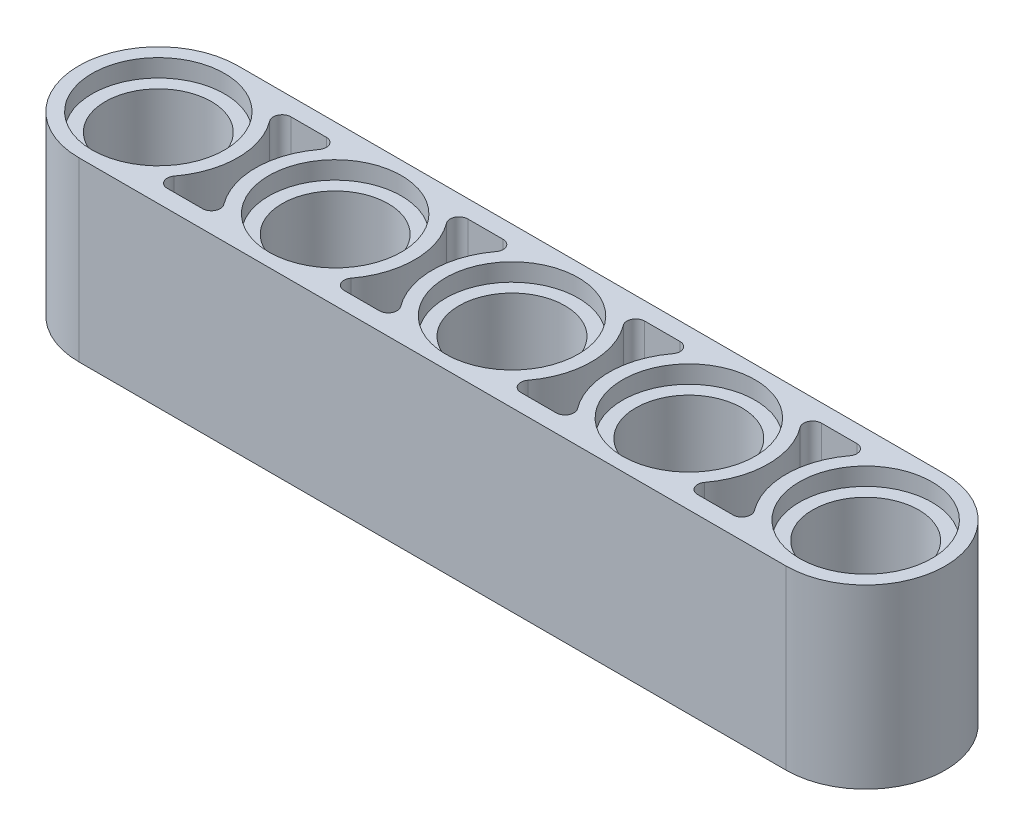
ISO-10303-21;
HEADER;
FILE_DESCRIPTION(('STEP AP214'),'2;1');
FILE_NAME('part.step','',(''),(''),'','','');
FILE_SCHEMA(('AUTOMOTIVE_DESIGN { 1 0 10303 214 1 1 1 1 }'));
ENDSEC;
DATA;
#1=APPLICATION_CONTEXT('core data for automotive mechanical design processes');
#2=APPLICATION_PROTOCOL_DEFINITION('international standard','automotive_design',2000,#1);
#3=PRODUCT_CONTEXT('',#1,'mechanical');
#4=PRODUCT('Part','Part','',(#3));
#5=PRODUCT_RELATED_PRODUCT_CATEGORY('part','',(#4));
#6=PRODUCT_DEFINITION_FORMATION('','',#4);
#7=PRODUCT_DEFINITION_CONTEXT('part definition',#1,'design');
#8=PRODUCT_DEFINITION('design','',#6,#7);
#9=PRODUCT_DEFINITION_SHAPE('','',#8);
#10=(LENGTH_UNIT() NAMED_UNIT(*) SI_UNIT(.MILLI.,.METRE.));
#11=(NAMED_UNIT(*) PLANE_ANGLE_UNIT() SI_UNIT($,.RADIAN.));
#12=(NAMED_UNIT(*) SI_UNIT($,.STERADIAN.) SOLID_ANGLE_UNIT());
#13=UNCERTAINTY_MEASURE_WITH_UNIT(LENGTH_MEASURE(1.E-05),#10,'distance_accuracy_value','');
#14=(GEOMETRIC_REPRESENTATION_CONTEXT(3) GLOBAL_UNCERTAINTY_ASSIGNED_CONTEXT((#13)) GLOBAL_UNIT_ASSIGNED_CONTEXT((#10,
#11,#12)) REPRESENTATION_CONTEXT('',''));
#15=CARTESIAN_POINT('',(0.,0.,0.));
#16=DIRECTION('',(0.,0.,1.));
#17=DIRECTION('',(1.,0.,0.));
#18=AXIS2_PLACEMENT_3D('',#15,#16,#17);
#19=CARTESIAN_POINT('',(0.,0.,0.));
#20=DIRECTION('',(0.,1.,0.));
#21=DIRECTION('',(0.,0.,1.));
#22=AXIS2_PLACEMENT_3D('',#19,#20,#21);
#23=PLANE('',#22);
#24=CARTESIAN_POINT('',(11.2,0.,2.4));
#25=DIRECTION('',(0.,1.,0.));
#26=DIRECTION('',(0.,0.,-1.));
#27=AXIS2_PLACEMENT_3D('',#24,#25,#26);
#28=CIRCLE('',#27,0.4);
#29=CARTESIAN_POINT('',(10.88,0.,2.16));
#30=VERTEX_POINT('',#29);
#31=CARTESIAN_POINT('',(11.2,0.,2.8));
#32=VERTEX_POINT('',#31);
#33=EDGE_CURVE('E59',#30,#32,#28,.T.);
#34=ORIENTED_EDGE('',*,*,#33,.T.);
#35=DIRECTION('',(1.,0.,0.));
#36=VECTOR('',#35,1.);
#37=CARTESIAN_POINT('',(12.8,0.,2.8));
#38=LINE('',#37,#36);
#39=CARTESIAN_POINT('',(12.8,0.,2.8));
#40=VERTEX_POINT('',#39);
#41=EDGE_CURVE('E536',#32,#40,#38,.T.);
#42=ORIENTED_EDGE('',*,*,#41,.T.);
#43=CARTESIAN_POINT('',(12.8,0.,2.4));
#44=DIRECTION('',(0.,1.,0.));
#45=DIRECTION('',(0.,0.,1.));
#46=AXIS2_PLACEMENT_3D('',#43,#44,#45);
#47=CIRCLE('',#46,0.4);
#48=CARTESIAN_POINT('',(13.12,0.,2.16));
#49=VERTEX_POINT('',#48);
#50=EDGE_CURVE('E568',#40,#49,#47,.T.);
#51=ORIENTED_EDGE('',*,*,#50,.T.);
#52=CARTESIAN_POINT('',(16.,0.,0.));
#53=DIRECTION('',(0.,-1.,0.));
#54=DIRECTION('',(0.,0.,1.));
#55=AXIS2_PLACEMENT_3D('',#52,#53,#54);
#56=CIRCLE('',#55,3.6);
#57=CARTESIAN_POINT('',(13.12,0.,-2.16));
#58=VERTEX_POINT('',#57);
#59=EDGE_CURVE('E565',#49,#58,#56,.T.);
#60=ORIENTED_EDGE('',*,*,#59,.T.);
#61=CARTESIAN_POINT('',(12.8,0.,-2.4));
#62=DIRECTION('',(0.,1.,0.));
#63=DIRECTION('',(0.,0.,-1.));
#64=AXIS2_PLACEMENT_3D('',#61,#62,#63);
#65=CIRCLE('',#64,0.4);
#66=CARTESIAN_POINT('',(12.8,0.,-2.8));
#67=VERTEX_POINT('',#66);
#68=EDGE_CURVE('E562',#58,#67,#65,.T.);
#69=ORIENTED_EDGE('',*,*,#68,.T.);
#70=DIRECTION('',(-1.,0.,0.));
#71=VECTOR('',#70,1.);
#72=CARTESIAN_POINT('',(11.2,0.,-2.8));
#73=LINE('',#72,#71);
#74=CARTESIAN_POINT('',(11.2,0.,-2.8));
#75=VERTEX_POINT('',#74);
#76=EDGE_CURVE('E559',#67,#75,#73,.T.);
#77=ORIENTED_EDGE('',*,*,#76,.T.);
#78=CARTESIAN_POINT('',(11.2,0.,-2.4));
#79=DIRECTION('',(0.,1.,0.));
#80=DIRECTION('',(0.,0.,1.));
#81=AXIS2_PLACEMENT_3D('',#78,#79,#80);
#82=CIRCLE('',#81,0.4);
#83=CARTESIAN_POINT('',(10.88,0.,-2.16));
#84=VERTEX_POINT('',#83);
#85=EDGE_CURVE('E556',#75,#84,#82,.T.);
#86=ORIENTED_EDGE('',*,*,#85,.T.);
#87=CARTESIAN_POINT('',(8.,0.,0.));
#88=DIRECTION('',(0.,-1.,0.));
#89=DIRECTION('',(0.,0.,1.));
#90=AXIS2_PLACEMENT_3D('',#87,#88,#89);
#91=CIRCLE('',#90,3.6);
#92=EDGE_CURVE('E552',#84,#30,#91,.T.);
#93=ORIENTED_EDGE('',*,*,#92,.T.);
#94=EDGE_LOOP('',(#34,#42,#51,#60,#69,#77,#86,#93));
#95=FACE_BOUND('',#94,.T.);
#96=CARTESIAN_POINT('',(27.2,0.,2.4));
#97=DIRECTION('',(0.,1.,0.));
#98=DIRECTION('',(0.,0.,-1.));
#99=AXIS2_PLACEMENT_3D('',#96,#97,#98);
#100=CIRCLE('',#99,0.399999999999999);
#101=CARTESIAN_POINT('',(26.88,0.,2.16));
#102=VERTEX_POINT('',#101);
#103=CARTESIAN_POINT('',(27.2,0.,2.8));
#104=VERTEX_POINT('',#103);
#105=EDGE_CURVE('E665',#102,#104,#100,.T.);
#106=ORIENTED_EDGE('',*,*,#105,.T.);
#107=DIRECTION('',(1.,0.,0.));
#108=VECTOR('',#107,1.);
#109=CARTESIAN_POINT('',(28.8,0.,2.8));
#110=LINE('',#109,#108);
#111=CARTESIAN_POINT('',(28.8,0.,2.8));
#112=VERTEX_POINT('',#111);
#113=EDGE_CURVE('E650',#104,#112,#110,.T.);
#114=ORIENTED_EDGE('',*,*,#113,.T.);
#115=CARTESIAN_POINT('',(28.8,0.,2.4));
#116=DIRECTION('',(0.,1.,0.));
#117=DIRECTION('',(0.,0.,1.));
#118=AXIS2_PLACEMENT_3D('',#115,#116,#117);
#119=CIRCLE('',#118,0.4);
#120=CARTESIAN_POINT('',(29.12,0.,2.16));
#121=VERTEX_POINT('',#120);
#122=EDGE_CURVE('E683',#112,#121,#119,.T.);
#123=ORIENTED_EDGE('',*,*,#122,.T.);
#124=CARTESIAN_POINT('',(32.,0.,0.));
#125=DIRECTION('',(0.,-1.,0.));
#126=DIRECTION('',(0.,0.,1.));
#127=AXIS2_PLACEMENT_3D('',#124,#125,#126);
#128=CIRCLE('',#127,3.6);
#129=CARTESIAN_POINT('',(29.12,0.,-2.16));
#130=VERTEX_POINT('',#129);
#131=EDGE_CURVE('E680',#121,#130,#128,.T.);
#132=ORIENTED_EDGE('',*,*,#131,.T.);
#133=CARTESIAN_POINT('',(28.8,0.,-2.4));
#134=DIRECTION('',(0.,1.,0.));
#135=DIRECTION('',(0.,0.,-1.));
#136=AXIS2_PLACEMENT_3D('',#133,#134,#135);
#137=CIRCLE('',#136,0.4);
#138=CARTESIAN_POINT('',(28.8,0.,-2.8));
#139=VERTEX_POINT('',#138);
#140=EDGE_CURVE('E677',#130,#139,#137,.T.);
#141=ORIENTED_EDGE('',*,*,#140,.T.);
#142=DIRECTION('',(-1.,0.,0.));
#143=VECTOR('',#142,1.);
#144=CARTESIAN_POINT('',(27.2,0.,-2.8));
#145=LINE('',#144,#143);
#146=CARTESIAN_POINT('',(27.2,0.,-2.8));
#147=VERTEX_POINT('',#146);
#148=EDGE_CURVE('E674',#139,#147,#145,.T.);
#149=ORIENTED_EDGE('',*,*,#148,.T.);
#150=CARTESIAN_POINT('',(27.2,0.,-2.4));
#151=DIRECTION('',(0.,1.,0.));
#152=DIRECTION('',(0.,0.,1.));
#153=AXIS2_PLACEMENT_3D('',#150,#151,#152);
#154=CIRCLE('',#153,0.4);
#155=CARTESIAN_POINT('',(26.88,0.,-2.16));
#156=VERTEX_POINT('',#155);
#157=EDGE_CURVE('E671',#147,#156,#154,.T.);
#158=ORIENTED_EDGE('',*,*,#157,.T.);
#159=CARTESIAN_POINT('',(24.,0.,0.));
#160=DIRECTION('',(0.,-1.,0.));
#161=DIRECTION('',(0.,0.,1.));
#162=AXIS2_PLACEMENT_3D('',#159,#160,#161);
#163=CIRCLE('',#162,3.6);
#164=EDGE_CURVE('E668',#156,#102,#163,.T.);
#165=ORIENTED_EDGE('',*,*,#164,.T.);
#166=EDGE_LOOP('',(#106,#114,#123,#132,#141,#149,#158,#165));
#167=FACE_BOUND('',#166,.T.);
#168=CARTESIAN_POINT('',(0.,0.,0.));
#169=DIRECTION('',(0.,1.,0.));
#170=DIRECTION('',(0.,0.,1.));
#171=AXIS2_PLACEMENT_3D('',#168,#169,#170);
#172=CIRCLE('',#171,3.);
#173=CARTESIAN_POINT('',(0.,0.,3.));
#174=VERTEX_POINT('',#173);
#175=EDGE_CURVE('E708',#174,#174,#172,.T.);
#176=ORIENTED_EDGE('',*,*,#175,.T.);
#177=EDGE_LOOP('',(#176));
#178=FACE_BOUND('',#177,.T.);
#179=CARTESIAN_POINT('',(8.,0.,0.));
#180=DIRECTION('',(0.,1.,0.));
#181=DIRECTION('',(0.,0.,1.));
#182=AXIS2_PLACEMENT_3D('',#179,#180,#181);
#183=CIRCLE('',#182,3.);
#184=CARTESIAN_POINT('',(8.,0.,3.));
#185=VERTEX_POINT('',#184);
#186=EDGE_CURVE('E714',#185,#185,#183,.T.);
#187=ORIENTED_EDGE('',*,*,#186,.T.);
#188=EDGE_LOOP('',(#187));
#189=FACE_BOUND('',#188,.T.);
#190=CARTESIAN_POINT('',(16.,0.,0.));
#191=DIRECTION('',(0.,1.,0.));
#192=DIRECTION('',(0.,0.,1.));
#193=AXIS2_PLACEMENT_3D('',#190,#191,#192);
#194=CIRCLE('',#193,3.);
#195=CARTESIAN_POINT('',(16.,0.,3.));
#196=VERTEX_POINT('',#195);
#197=EDGE_CURVE('E720',#196,#196,#194,.T.);
#198=ORIENTED_EDGE('',*,*,#197,.T.);
#199=EDGE_LOOP('',(#198));
#200=FACE_BOUND('',#199,.T.);
#201=CARTESIAN_POINT('',(24.,0.,0.));
#202=DIRECTION('',(0.,1.,0.));
#203=DIRECTION('',(0.,0.,1.));
#204=AXIS2_PLACEMENT_3D('',#201,#202,#203);
#205=CIRCLE('',#204,3.);
#206=CARTESIAN_POINT('',(24.,0.,3.));
#207=VERTEX_POINT('',#206);
#208=EDGE_CURVE('E726',#207,#207,#205,.T.);
#209=ORIENTED_EDGE('',*,*,#208,.T.);
#210=EDGE_LOOP('',(#209));
#211=FACE_BOUND('',#210,.T.);
#212=CARTESIAN_POINT('',(32.,0.,0.));
#213=DIRECTION('',(0.,1.,0.));
#214=DIRECTION('',(0.,0.,1.));
#215=AXIS2_PLACEMENT_3D('',#212,#213,#214);
#216=CIRCLE('',#215,3.);
#217=CARTESIAN_POINT('',(32.,0.,3.));
#218=VERTEX_POINT('',#217);
#219=EDGE_CURVE('E520',#218,#218,#216,.T.);
#220=ORIENTED_EDGE('',*,*,#219,.T.);
#221=EDGE_LOOP('',(#220));
#222=FACE_BOUND('',#221,.T.);
#223=CARTESIAN_POINT('',(0.,0.,0.));
#224=DIRECTION('',(0.,1.,0.));
#225=DIRECTION('',(0.,0.,1.));
#226=AXIS2_PLACEMENT_3D('',#223,#224,#225);
#227=CIRCLE('',#226,3.6);
#228=CARTESIAN_POINT('',(0.,0.,-3.6));
#229=VERTEX_POINT('',#228);
#230=CARTESIAN_POINT('',(0.,0.,3.6));
#231=VERTEX_POINT('',#230);
#232=EDGE_CURVE('E1032',#229,#231,#227,.T.);
#233=ORIENTED_EDGE('',*,*,#232,.F.);
#234=DIRECTION('',(-1.,0.,0.));
#235=VECTOR('',#234,1.);
#236=CARTESIAN_POINT('',(0.,0.,-3.6));
#237=LINE('',#236,#235);
#238=CARTESIAN_POINT('',(32.,0.,-3.6));
#239=VERTEX_POINT('',#238);
#240=EDGE_CURVE('E1025',#239,#229,#237,.T.);
#241=ORIENTED_EDGE('',*,*,#240,.F.);
#242=CARTESIAN_POINT('',(32.,0.,0.));
#243=DIRECTION('',(0.,1.,0.));
#244=DIRECTION('',(0.,0.,1.));
#245=AXIS2_PLACEMENT_3D('',#242,#243,#244);
#246=CIRCLE('',#245,3.6);
#247=CARTESIAN_POINT('',(32.,0.,3.6));
#248=VERTEX_POINT('',#247);
#249=EDGE_CURVE('E1038',#248,#239,#246,.T.);
#250=ORIENTED_EDGE('',*,*,#249,.F.);
#251=DIRECTION('',(1.,0.,0.));
#252=VECTOR('',#251,1.);
#253=CARTESIAN_POINT('',(32.,0.,3.6));
#254=LINE('',#253,#252);
#255=EDGE_CURVE('E1035',#231,#248,#254,.T.);
#256=ORIENTED_EDGE('',*,*,#255,.F.);
#257=EDGE_LOOP('',(#233,#241,#250,#256));
#258=FACE_BOUND('',#257,.T.);
#259=CARTESIAN_POINT('',(19.2,0.,2.4));
#260=DIRECTION('',(0.,1.,0.));
#261=DIRECTION('',(0.,0.,-1.));
#262=AXIS2_PLACEMENT_3D('',#259,#260,#261);
#263=CIRCLE('',#262,0.399999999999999);
#264=CARTESIAN_POINT('',(18.88,0.,2.16));
#265=VERTEX_POINT('',#264);
#266=CARTESIAN_POINT('',(19.2,0.,2.8));
#267=VERTEX_POINT('',#266);
#268=EDGE_CURVE('E606',#265,#267,#263,.T.);
#269=ORIENTED_EDGE('',*,*,#268,.T.);
#270=DIRECTION('',(1.,0.,0.));
#271=VECTOR('',#270,1.);
#272=CARTESIAN_POINT('',(20.8,0.,2.8));
#273=LINE('',#272,#271);
#274=CARTESIAN_POINT('',(20.8,0.,2.8));
#275=VERTEX_POINT('',#274);
#276=EDGE_CURVE('E591',#267,#275,#273,.T.);
#277=ORIENTED_EDGE('',*,*,#276,.T.);
#278=CARTESIAN_POINT('',(20.8,0.,2.4));
#279=DIRECTION('',(0.,1.,0.));
#280=DIRECTION('',(0.,0.,1.));
#281=AXIS2_PLACEMENT_3D('',#278,#279,#280);
#282=CIRCLE('',#281,0.4);
#283=CARTESIAN_POINT('',(21.12,0.,2.16));
#284=VERTEX_POINT('',#283);
#285=EDGE_CURVE('E625',#275,#284,#282,.T.);
#286=ORIENTED_EDGE('',*,*,#285,.T.);
#287=CARTESIAN_POINT('',(24.,0.,0.));
#288=DIRECTION('',(0.,-1.,0.));
#289=DIRECTION('',(0.,0.,1.));
#290=AXIS2_PLACEMENT_3D('',#287,#288,#289);
#291=CIRCLE('',#290,3.6);
#292=CARTESIAN_POINT('',(21.12,0.,-2.16));
#293=VERTEX_POINT('',#292);
#294=EDGE_CURVE('E622',#284,#293,#291,.T.);
#295=ORIENTED_EDGE('',*,*,#294,.T.);
#296=CARTESIAN_POINT('',(20.8,0.,-2.4));
#297=DIRECTION('',(0.,1.,0.));
#298=DIRECTION('',(0.,0.,-1.));
#299=AXIS2_PLACEMENT_3D('',#296,#297,#298);
#300=CIRCLE('',#299,0.4);
#301=CARTESIAN_POINT('',(20.8,0.,-2.8));
#302=VERTEX_POINT('',#301);
#303=EDGE_CURVE('E619',#293,#302,#300,.T.);
#304=ORIENTED_EDGE('',*,*,#303,.T.);
#305=DIRECTION('',(-1.,0.,0.));
#306=VECTOR('',#305,1.);
#307=CARTESIAN_POINT('',(19.2,0.,-2.8));
#308=LINE('',#307,#306);
#309=CARTESIAN_POINT('',(19.2,0.,-2.8));
#310=VERTEX_POINT('',#309);
#311=EDGE_CURVE('E616',#302,#310,#308,.T.);
#312=ORIENTED_EDGE('',*,*,#311,.T.);
#313=CARTESIAN_POINT('',(19.2,0.,-2.4));
#314=DIRECTION('',(0.,1.,0.));
#315=DIRECTION('',(0.,0.,1.));
#316=AXIS2_PLACEMENT_3D('',#313,#314,#315);
#317=CIRCLE('',#316,0.4);
#318=CARTESIAN_POINT('',(18.88,0.,-2.16));
#319=VERTEX_POINT('',#318);
#320=EDGE_CURVE('E613',#310,#319,#317,.T.);
#321=ORIENTED_EDGE('',*,*,#320,.T.);
#322=CARTESIAN_POINT('',(16.,0.,0.));
#323=DIRECTION('',(0.,-1.,0.));
#324=DIRECTION('',(0.,0.,1.));
#325=AXIS2_PLACEMENT_3D('',#322,#323,#324);
#326=CIRCLE('',#325,3.6);
#327=EDGE_CURVE('E609',#319,#265,#326,.T.);
#328=ORIENTED_EDGE('',*,*,#327,.T.);
#329=EDGE_LOOP('',(#269,#277,#286,#295,#304,#312,#321,#328));
#330=FACE_BOUND('',#329,.T.);
#331=CARTESIAN_POINT('',(3.2,0.,2.4));
#332=DIRECTION('',(0.,1.,0.));
#333=DIRECTION('',(0.,0.,-1.));
#334=AXIS2_PLACEMENT_3D('',#331,#332,#333);
#335=CIRCLE('',#334,0.4);
#336=CARTESIAN_POINT('',(2.88,0.,2.16));
#337=VERTEX_POINT('',#336);
#338=CARTESIAN_POINT('',(3.2,0.,2.8));
#339=VERTEX_POINT('',#338);
#340=EDGE_CURVE('E51',#337,#339,#335,.T.);
#341=ORIENTED_EDGE('',*,*,#340,.T.);
#342=DIRECTION('',(1.,0.,0.));
#343=VECTOR('',#342,1.);
#344=CARTESIAN_POINT('',(4.8,0.,2.8));
#345=LINE('',#344,#343);
#346=CARTESIAN_POINT('',(4.8,0.,2.8));
#347=VERTEX_POINT('',#346);
#348=EDGE_CURVE('E484',#339,#347,#345,.T.);
#349=ORIENTED_EDGE('',*,*,#348,.T.);
#350=CARTESIAN_POINT('',(4.8,0.,2.4));
#351=DIRECTION('',(0.,1.,0.));
#352=DIRECTION('',(0.,0.,1.));
#353=AXIS2_PLACEMENT_3D('',#350,#351,#352);
#354=CIRCLE('',#353,0.4);
#355=CARTESIAN_POINT('',(5.12,0.,2.16));
#356=VERTEX_POINT('',#355);
#357=EDGE_CURVE('E487',#347,#356,#354,.T.);
#358=ORIENTED_EDGE('',*,*,#357,.T.);
#359=CARTESIAN_POINT('',(8.,0.,0.));
#360=DIRECTION('',(0.,-1.,0.));
#361=DIRECTION('',(0.,0.,1.));
#362=AXIS2_PLACEMENT_3D('',#359,#360,#361);
#363=CIRCLE('',#362,3.6);
#364=CARTESIAN_POINT('',(5.12,0.,-2.16));
#365=VERTEX_POINT('',#364);
#366=EDGE_CURVE('E513',#356,#365,#363,.T.);
#367=ORIENTED_EDGE('',*,*,#366,.T.);
#368=CARTESIAN_POINT('',(4.8,0.,-2.4));
#369=DIRECTION('',(0.,1.,0.));
#370=DIRECTION('',(0.,0.,-1.));
#371=AXIS2_PLACEMENT_3D('',#368,#369,#370);
#372=CIRCLE('',#371,0.4);
#373=CARTESIAN_POINT('',(4.8,0.,-2.8));
#374=VERTEX_POINT('',#373);
#375=EDGE_CURVE('E510',#365,#374,#372,.T.);
#376=ORIENTED_EDGE('',*,*,#375,.T.);
#377=DIRECTION('',(-1.,0.,0.));
#378=VECTOR('',#377,1.);
#379=CARTESIAN_POINT('',(3.2,0.,-2.8));
#380=LINE('',#379,#378);
#381=CARTESIAN_POINT('',(3.2,0.,-2.8));
#382=VERTEX_POINT('',#381);
#383=EDGE_CURVE('E507',#374,#382,#380,.T.);
#384=ORIENTED_EDGE('',*,*,#383,.T.);
#385=CARTESIAN_POINT('',(3.2,0.,-2.4));
#386=DIRECTION('',(0.,1.,0.));
#387=DIRECTION('',(0.,0.,1.));
#388=AXIS2_PLACEMENT_3D('',#385,#386,#387);
#389=CIRCLE('',#388,0.4);
#390=CARTESIAN_POINT('',(2.88,0.,-2.16));
#391=VERTEX_POINT('',#390);
#392=EDGE_CURVE('E504',#382,#391,#389,.T.);
#393=ORIENTED_EDGE('',*,*,#392,.T.);
#394=CARTESIAN_POINT('',(0.,0.,0.));
#395=DIRECTION('',(0.,-1.,0.));
#396=DIRECTION('',(0.,0.,1.));
#397=AXIS2_PLACEMENT_3D('',#394,#395,#396);
#398=CIRCLE('',#397,3.6);
#399=EDGE_CURVE('E501',#391,#337,#398,.T.);
#400=ORIENTED_EDGE('',*,*,#399,.T.);
#401=EDGE_LOOP('',(#341,#349,#358,#367,#376,#384,#393,#400));
#402=FACE_BOUND('',#401,.T.);
#403=ADVANCED_FACE('F34',(#95,#167,#178,#189,#200,#211,#222,#258,#330,#402),#23,.F.);
#404=CARTESIAN_POINT('',(0.,8.,0.));
#405=DIRECTION('',(0.,-1.,0.));
#406=DIRECTION('',(0.,0.,-1.));
#407=AXIS2_PLACEMENT_3D('',#404,#405,#406);
#408=CYLINDRICAL_SURFACE('',#407,2.4);
#409=CARTESIAN_POINT('',(0.,7.2,0.));
#410=DIRECTION('',(0.,1.,0.));
#411=DIRECTION('',(0.,0.,1.));
#412=AXIS2_PLACEMENT_3D('',#409,#410,#411);
#413=CIRCLE('',#412,2.4);
#414=CARTESIAN_POINT('',(0.,7.2,2.4));
#415=VERTEX_POINT('',#414);
#416=EDGE_CURVE('E1036',#415,#415,#413,.T.);
#417=ORIENTED_EDGE('',*,*,#416,.T.);
#418=EDGE_LOOP('',(#417));
#419=FACE_BOUND('',#418,.T.);
#420=CARTESIAN_POINT('',(0.,0.8,0.));
#421=DIRECTION('',(0.,-1.,0.));
#422=DIRECTION('',(0.,0.,-1.));
#423=AXIS2_PLACEMENT_3D('',#420,#421,#422);
#424=CIRCLE('',#423,2.4);
#425=CARTESIAN_POINT('',(0.,0.8,-2.4));
#426=VERTEX_POINT('',#425);
#427=EDGE_CURVE('E38',#426,#426,#424,.T.);
#428=ORIENTED_EDGE('',*,*,#427,.T.);
#429=EDGE_LOOP('',(#428));
#430=FACE_BOUND('',#429,.T.);
#431=ADVANCED_FACE('F1075',(#419,#430),#408,.F.);
#432=CARTESIAN_POINT('',(8.,8.,0.));
#433=DIRECTION('',(0.,-1.,0.));
#434=DIRECTION('',(0.,0.,-1.));
#435=AXIS2_PLACEMENT_3D('',#432,#433,#434);
#436=CYLINDRICAL_SURFACE('',#435,2.4);
#437=CARTESIAN_POINT('',(8.,7.2,0.));
#438=DIRECTION('',(0.,1.,0.));
#439=DIRECTION('',(0.,0.,1.));
#440=AXIS2_PLACEMENT_3D('',#437,#438,#439);
#441=CIRCLE('',#440,2.4);
#442=CARTESIAN_POINT('',(8.,7.2,2.4));
#443=VERTEX_POINT('',#442);
#444=EDGE_CURVE('E1056',#443,#443,#441,.T.);
#445=ORIENTED_EDGE('',*,*,#444,.T.);
#446=EDGE_LOOP('',(#445));
#447=FACE_BOUND('',#446,.T.);
#448=CARTESIAN_POINT('',(8.,0.8,0.));
#449=DIRECTION('',(0.,-1.,0.));
#450=DIRECTION('',(0.,0.,-1.));
#451=AXIS2_PLACEMENT_3D('',#448,#449,#450);
#452=CIRCLE('',#451,2.4);
#453=CARTESIAN_POINT('',(8.,0.8,-2.4));
#454=VERTEX_POINT('',#453);
#455=EDGE_CURVE('E1068',#454,#454,#452,.T.);
#456=ORIENTED_EDGE('',*,*,#455,.T.);
#457=EDGE_LOOP('',(#456));
#458=FACE_BOUND('',#457,.T.);
#459=ADVANCED_FACE('F1486',(#447,#458),#436,.F.);
#460=CARTESIAN_POINT('',(16.,8.,0.));
#461=DIRECTION('',(0.,-1.,0.));
#462=DIRECTION('',(0.,0.,-1.));
#463=AXIS2_PLACEMENT_3D('',#460,#461,#462);
#464=CYLINDRICAL_SURFACE('',#463,2.4);
#465=CARTESIAN_POINT('',(16.,7.2,0.));
#466=DIRECTION('',(0.,1.,0.));
#467=DIRECTION('',(0.,0.,1.));
#468=AXIS2_PLACEMENT_3D('',#465,#466,#467);
#469=CIRCLE('',#468,2.4);
#470=CARTESIAN_POINT('',(16.,7.2,2.4));
#471=VERTEX_POINT('',#470);
#472=EDGE_CURVE('E1053',#471,#471,#469,.T.);
#473=ORIENTED_EDGE('',*,*,#472,.T.);
#474=EDGE_LOOP('',(#473));
#475=FACE_BOUND('',#474,.T.);
#476=CARTESIAN_POINT('',(16.,0.8,0.));
#477=DIRECTION('',(0.,-1.,0.));
#478=DIRECTION('',(0.,0.,-1.));
#479=AXIS2_PLACEMENT_3D('',#476,#477,#478);
#480=CIRCLE('',#479,2.4);
#481=CARTESIAN_POINT('',(16.,0.8,-2.4));
#482=VERTEX_POINT('',#481);
#483=EDGE_CURVE('E1066',#482,#482,#480,.T.);
#484=ORIENTED_EDGE('',*,*,#483,.T.);
#485=EDGE_LOOP('',(#484));
#486=FACE_BOUND('',#485,.T.);
#487=ADVANCED_FACE('F1482',(#475,#486),#464,.F.);
#488=CARTESIAN_POINT('',(24.,8.,0.));
#489=DIRECTION('',(0.,-1.,0.));
#490=DIRECTION('',(0.,0.,-1.));
#491=AXIS2_PLACEMENT_3D('',#488,#489,#490);
#492=CYLINDRICAL_SURFACE('',#491,2.4);
#493=CARTESIAN_POINT('',(24.,7.2,0.));
#494=DIRECTION('',(0.,1.,0.));
#495=DIRECTION('',(0.,0.,1.));
#496=AXIS2_PLACEMENT_3D('',#493,#494,#495);
#497=CIRCLE('',#496,2.4);
#498=CARTESIAN_POINT('',(24.,7.2,2.4));
#499=VERTEX_POINT('',#498);
#500=EDGE_CURVE('E1050',#499,#499,#497,.T.);
#501=ORIENTED_EDGE('',*,*,#500,.T.);
#502=EDGE_LOOP('',(#501));
#503=FACE_BOUND('',#502,.T.);
#504=CARTESIAN_POINT('',(24.,0.8,0.));
#505=DIRECTION('',(0.,-1.,0.));
#506=DIRECTION('',(0.,0.,-1.));
#507=AXIS2_PLACEMENT_3D('',#504,#505,#506);
#508=CIRCLE('',#507,2.4);
#509=CARTESIAN_POINT('',(24.,0.8,-2.4));
#510=VERTEX_POINT('',#509);
#511=EDGE_CURVE('E1063',#510,#510,#508,.T.);
#512=ORIENTED_EDGE('',*,*,#511,.T.);
#513=EDGE_LOOP('',(#512));
#514=FACE_BOUND('',#513,.T.);
#515=ADVANCED_FACE('F1478',(#503,#514),#492,.F.);
#516=CARTESIAN_POINT('',(32.,8.,0.));
#517=DIRECTION('',(0.,-1.,0.));
#518=DIRECTION('',(0.,0.,-1.));
#519=AXIS2_PLACEMENT_3D('',#516,#517,#518);
#520=CYLINDRICAL_SURFACE('',#519,2.4);
#521=CARTESIAN_POINT('',(32.,7.2,0.));
#522=DIRECTION('',(0.,1.,0.));
#523=DIRECTION('',(0.,0.,1.));
#524=AXIS2_PLACEMENT_3D('',#521,#522,#523);
#525=CIRCLE('',#524,2.4);
#526=CARTESIAN_POINT('',(32.,7.2,2.4));
#527=VERTEX_POINT('',#526);
#528=EDGE_CURVE('E994',#527,#527,#525,.T.);
#529=ORIENTED_EDGE('',*,*,#528,.T.);
#530=EDGE_LOOP('',(#529));
#531=FACE_BOUND('',#530,.T.);
#532=CARTESIAN_POINT('',(32.,0.8,0.));
#533=DIRECTION('',(0.,-1.,0.));
#534=DIRECTION('',(0.,0.,-1.));
#535=AXIS2_PLACEMENT_3D('',#532,#533,#534);
#536=CIRCLE('',#535,2.4);
#537=CARTESIAN_POINT('',(32.,0.8,-2.4));
#538=VERTEX_POINT('',#537);
#539=EDGE_CURVE('E707',#538,#538,#536,.T.);
#540=ORIENTED_EDGE('',*,*,#539,.T.);
#541=EDGE_LOOP('',(#540));
#542=FACE_BOUND('',#541,.T.);
#543=ADVANCED_FACE('F1474',(#531,#542),#520,.F.);
#544=CARTESIAN_POINT('',(0.,8.,0.));
#545=DIRECTION('',(0.,1.,0.));
#546=DIRECTION('',(0.,0.,1.));
#547=AXIS2_PLACEMENT_3D('',#544,#545,#546);
#548=PLANE('',#547);
#549=CARTESIAN_POINT('',(3.2,8.,2.4));
#550=DIRECTION('',(0.,1.,0.));
#551=DIRECTION('',(0.,0.,-1.));
#552=AXIS2_PLACEMENT_3D('',#549,#550,#551);
#553=CIRCLE('',#552,0.4);
#554=CARTESIAN_POINT('',(2.88,8.,2.16));
#555=VERTEX_POINT('',#554);
#556=CARTESIAN_POINT('',(3.2,8.,2.8));
#557=VERTEX_POINT('',#556);
#558=EDGE_CURVE('E760',#555,#557,#553,.T.);
#559=ORIENTED_EDGE('',*,*,#558,.F.);
#560=CARTESIAN_POINT('',(0.,8.,0.));
#561=DIRECTION('',(0.,-1.,0.));
#562=DIRECTION('',(0.,0.,1.));
#563=AXIS2_PLACEMENT_3D('',#560,#561,#562);
#564=CIRCLE('',#563,3.6);
#565=CARTESIAN_POINT('',(2.88,8.,-2.16));
#566=VERTEX_POINT('',#565);
#567=EDGE_CURVE('E738',#566,#555,#564,.T.);
#568=ORIENTED_EDGE('',*,*,#567,.F.);
#569=CARTESIAN_POINT('',(3.2,8.,-2.4));
#570=DIRECTION('',(0.,1.,0.));
#571=DIRECTION('',(0.,0.,1.));
#572=AXIS2_PLACEMENT_3D('',#569,#570,#571);
#573=CIRCLE('',#572,0.4);
#574=CARTESIAN_POINT('',(3.2,8.,-2.8));
#575=VERTEX_POINT('',#574);
#576=EDGE_CURVE('E778',#575,#566,#573,.T.);
#577=ORIENTED_EDGE('',*,*,#576,.F.);
#578=DIRECTION('',(-1.,0.,0.));
#579=VECTOR('',#578,1.);
#580=CARTESIAN_POINT('',(3.2,8.,-2.8));
#581=LINE('',#580,#579);
#582=CARTESIAN_POINT('',(4.8,8.,-2.8));
#583=VERTEX_POINT('',#582);
#584=EDGE_CURVE('E775',#583,#575,#581,.T.);
#585=ORIENTED_EDGE('',*,*,#584,.F.);
#586=CARTESIAN_POINT('',(4.8,8.,-2.4));
#587=DIRECTION('',(0.,1.,0.));
#588=DIRECTION('',(0.,0.,-1.));
#589=AXIS2_PLACEMENT_3D('',#586,#587,#588);
#590=CIRCLE('',#589,0.4);
#591=CARTESIAN_POINT('',(5.12,8.,-2.16));
#592=VERTEX_POINT('',#591);
#593=EDGE_CURVE('E772',#592,#583,#590,.T.);
#594=ORIENTED_EDGE('',*,*,#593,.F.);
#595=CARTESIAN_POINT('',(8.,8.,0.));
#596=DIRECTION('',(0.,-1.,0.));
#597=DIRECTION('',(0.,0.,1.));
#598=AXIS2_PLACEMENT_3D('',#595,#596,#597);
#599=CIRCLE('',#598,3.6);
#600=CARTESIAN_POINT('',(5.12,8.,2.16));
#601=VERTEX_POINT('',#600);
#602=EDGE_CURVE('E769',#601,#592,#599,.T.);
#603=ORIENTED_EDGE('',*,*,#602,.F.);
#604=CARTESIAN_POINT('',(4.8,8.,2.4));
#605=DIRECTION('',(0.,1.,0.));
#606=DIRECTION('',(0.,0.,1.));
#607=AXIS2_PLACEMENT_3D('',#604,#605,#606);
#608=CIRCLE('',#607,0.4);
#609=CARTESIAN_POINT('',(4.8,8.,2.8));
#610=VERTEX_POINT('',#609);
#611=EDGE_CURVE('E766',#610,#601,#608,.T.);
#612=ORIENTED_EDGE('',*,*,#611,.F.);
#613=DIRECTION('',(1.,0.,0.));
#614=VECTOR('',#613,1.);
#615=CARTESIAN_POINT('',(4.8,8.,2.8));
#616=LINE('',#615,#614);
#617=EDGE_CURVE('E762',#557,#610,#616,.T.);
#618=ORIENTED_EDGE('',*,*,#617,.F.);
#619=EDGE_LOOP('',(#559,#568,#577,#585,#594,#603,#612,#618));
#620=FACE_BOUND('',#619,.T.);
#621=CARTESIAN_POINT('',(11.2,8.,2.4));
#622=DIRECTION('',(0.,1.,0.));
#623=DIRECTION('',(0.,0.,-1.));
#624=AXIS2_PLACEMENT_3D('',#621,#622,#623);
#625=CIRCLE('',#624,0.4);
#626=CARTESIAN_POINT('',(10.88,8.,2.16));
#627=VERTEX_POINT('',#626);
#628=CARTESIAN_POINT('',(11.2,8.,2.8));
#629=VERTEX_POINT('',#628);
#630=EDGE_CURVE('E826',#627,#629,#625,.T.);
#631=ORIENTED_EDGE('',*,*,#630,.F.);
#632=CARTESIAN_POINT('',(8.,8.,0.));
#633=DIRECTION('',(0.,-1.,0.));
#634=DIRECTION('',(0.,0.,1.));
#635=AXIS2_PLACEMENT_3D('',#632,#633,#634);
#636=CIRCLE('',#635,3.6);
#637=CARTESIAN_POINT('',(10.88,8.,-2.16));
#638=VERTEX_POINT('',#637);
#639=EDGE_CURVE('E804',#638,#627,#636,.T.);
#640=ORIENTED_EDGE('',*,*,#639,.F.);
#641=CARTESIAN_POINT('',(11.2,8.,-2.4));
#642=DIRECTION('',(0.,1.,0.));
#643=DIRECTION('',(0.,0.,1.));
#644=AXIS2_PLACEMENT_3D('',#641,#642,#643);
#645=CIRCLE('',#644,0.4);
#646=CARTESIAN_POINT('',(11.2,8.,-2.8));
#647=VERTEX_POINT('',#646);
#648=EDGE_CURVE('E844',#647,#638,#645,.T.);
#649=ORIENTED_EDGE('',*,*,#648,.F.);
#650=DIRECTION('',(-1.,0.,0.));
#651=VECTOR('',#650,1.);
#652=CARTESIAN_POINT('',(11.2,8.,-2.8));
#653=LINE('',#652,#651);
#654=CARTESIAN_POINT('',(12.8,8.,-2.8));
#655=VERTEX_POINT('',#654);
#656=EDGE_CURVE('E841',#655,#647,#653,.T.);
#657=ORIENTED_EDGE('',*,*,#656,.F.);
#658=CARTESIAN_POINT('',(12.8,8.,-2.4));
#659=DIRECTION('',(0.,1.,0.));
#660=DIRECTION('',(0.,0.,-1.));
#661=AXIS2_PLACEMENT_3D('',#658,#659,#660);
#662=CIRCLE('',#661,0.4);
#663=CARTESIAN_POINT('',(13.12,8.,-2.16));
#664=VERTEX_POINT('',#663);
#665=EDGE_CURVE('E838',#664,#655,#662,.T.);
#666=ORIENTED_EDGE('',*,*,#665,.F.);
#667=CARTESIAN_POINT('',(16.,8.,0.));
#668=DIRECTION('',(0.,-1.,0.));
#669=DIRECTION('',(0.,0.,1.));
#670=AXIS2_PLACEMENT_3D('',#667,#668,#669);
#671=CIRCLE('',#670,3.6);
#672=CARTESIAN_POINT('',(13.12,8.,2.16));
#673=VERTEX_POINT('',#672);
#674=EDGE_CURVE('E835',#673,#664,#671,.T.);
#675=ORIENTED_EDGE('',*,*,#674,.F.);
#676=CARTESIAN_POINT('',(12.8,8.,2.4));
#677=DIRECTION('',(0.,1.,0.));
#678=DIRECTION('',(0.,0.,1.));
#679=AXIS2_PLACEMENT_3D('',#676,#677,#678);
#680=CIRCLE('',#679,0.4);
#681=CARTESIAN_POINT('',(12.8,8.,2.8));
#682=VERTEX_POINT('',#681);
#683=EDGE_CURVE('E832',#682,#673,#680,.T.);
#684=ORIENTED_EDGE('',*,*,#683,.F.);
#685=DIRECTION('',(1.,0.,0.));
#686=VECTOR('',#685,1.);
#687=CARTESIAN_POINT('',(12.8,8.,2.8));
#688=LINE('',#687,#686);
#689=EDGE_CURVE('E828',#629,#682,#688,.T.);
#690=ORIENTED_EDGE('',*,*,#689,.F.);
#691=EDGE_LOOP('',(#631,#640,#649,#657,#666,#675,#684,#690));
#692=FACE_BOUND('',#691,.T.);
#693=CARTESIAN_POINT('',(19.2,8.,2.4));
#694=DIRECTION('',(0.,1.,0.));
#695=DIRECTION('',(0.,0.,-1.));
#696=AXIS2_PLACEMENT_3D('',#693,#694,#695);
#697=CIRCLE('',#696,0.399999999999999);
#698=CARTESIAN_POINT('',(18.88,8.,2.16));
#699=VERTEX_POINT('',#698);
#700=CARTESIAN_POINT('',(19.2,8.,2.8));
#701=VERTEX_POINT('',#700);
#702=EDGE_CURVE('E890',#699,#701,#697,.T.);
#703=ORIENTED_EDGE('',*,*,#702,.F.);
#704=CARTESIAN_POINT('',(16.,8.,0.));
#705=DIRECTION('',(0.,-1.,0.));
#706=DIRECTION('',(0.,0.,1.));
#707=AXIS2_PLACEMENT_3D('',#704,#705,#706);
#708=CIRCLE('',#707,3.6);
#709=CARTESIAN_POINT('',(18.88,8.,-2.16));
#710=VERTEX_POINT('',#709);
#711=EDGE_CURVE('E868',#710,#699,#708,.T.);
#712=ORIENTED_EDGE('',*,*,#711,.F.);
#713=CARTESIAN_POINT('',(19.2,8.,-2.4));
#714=DIRECTION('',(0.,1.,0.));
#715=DIRECTION('',(0.,0.,1.));
#716=AXIS2_PLACEMENT_3D('',#713,#714,#715);
#717=CIRCLE('',#716,0.4);
#718=CARTESIAN_POINT('',(19.2,8.,-2.8));
#719=VERTEX_POINT('',#718);
#720=EDGE_CURVE('E908',#719,#710,#717,.T.);
#721=ORIENTED_EDGE('',*,*,#720,.F.);
#722=DIRECTION('',(-1.,0.,0.));
#723=VECTOR('',#722,1.);
#724=CARTESIAN_POINT('',(19.2,8.,-2.8));
#725=LINE('',#724,#723);
#726=CARTESIAN_POINT('',(20.8,8.,-2.8));
#727=VERTEX_POINT('',#726);
#728=EDGE_CURVE('E905',#727,#719,#725,.T.);
#729=ORIENTED_EDGE('',*,*,#728,.F.);
#730=CARTESIAN_POINT('',(20.8,8.,-2.4));
#731=DIRECTION('',(0.,1.,0.));
#732=DIRECTION('',(0.,0.,-1.));
#733=AXIS2_PLACEMENT_3D('',#730,#731,#732);
#734=CIRCLE('',#733,0.4);
#735=CARTESIAN_POINT('',(21.12,8.,-2.16));
#736=VERTEX_POINT('',#735);
#737=EDGE_CURVE('E902',#736,#727,#734,.T.);
#738=ORIENTED_EDGE('',*,*,#737,.F.);
#739=CARTESIAN_POINT('',(24.,8.,0.));
#740=DIRECTION('',(0.,-1.,0.));
#741=DIRECTION('',(0.,0.,1.));
#742=AXIS2_PLACEMENT_3D('',#739,#740,#741);
#743=CIRCLE('',#742,3.6);
#744=CARTESIAN_POINT('',(21.12,8.,2.16));
#745=VERTEX_POINT('',#744);
#746=EDGE_CURVE('E899',#745,#736,#743,.T.);
#747=ORIENTED_EDGE('',*,*,#746,.F.);
#748=CARTESIAN_POINT('',(20.8,8.,2.4));
#749=DIRECTION('',(0.,1.,0.));
#750=DIRECTION('',(0.,0.,1.));
#751=AXIS2_PLACEMENT_3D('',#748,#749,#750);
#752=CIRCLE('',#751,0.4);
#753=CARTESIAN_POINT('',(20.8,8.,2.8));
#754=VERTEX_POINT('',#753);
#755=EDGE_CURVE('E896',#754,#745,#752,.T.);
#756=ORIENTED_EDGE('',*,*,#755,.F.);
#757=DIRECTION('',(1.,0.,0.));
#758=VECTOR('',#757,1.);
#759=CARTESIAN_POINT('',(20.8,8.,2.8));
#760=LINE('',#759,#758);
#761=EDGE_CURVE('E892',#701,#754,#760,.T.);
#762=ORIENTED_EDGE('',*,*,#761,.F.);
#763=EDGE_LOOP('',(#703,#712,#721,#729,#738,#747,#756,#762));
#764=FACE_BOUND('',#763,.T.);
#765=CARTESIAN_POINT('',(27.2,8.,2.4));
#766=DIRECTION('',(0.,1.,0.));
#767=DIRECTION('',(0.,0.,-1.));
#768=AXIS2_PLACEMENT_3D('',#765,#766,#767);
#769=CIRCLE('',#768,0.399999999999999);
#770=CARTESIAN_POINT('',(26.88,8.,2.16));
#771=VERTEX_POINT('',#770);
#772=CARTESIAN_POINT('',(27.2,8.,2.8));
#773=VERTEX_POINT('',#772);
#774=EDGE_CURVE('E954',#771,#773,#769,.T.);
#775=ORIENTED_EDGE('',*,*,#774,.F.);
#776=CARTESIAN_POINT('',(24.,8.,0.));
#777=DIRECTION('',(0.,-1.,0.));
#778=DIRECTION('',(0.,0.,1.));
#779=AXIS2_PLACEMENT_3D('',#776,#777,#778);
#780=CIRCLE('',#779,3.6);
#781=CARTESIAN_POINT('',(26.88,8.,-2.16));
#782=VERTEX_POINT('',#781);
#783=EDGE_CURVE('E932',#782,#771,#780,.T.);
#784=ORIENTED_EDGE('',*,*,#783,.F.);
#785=CARTESIAN_POINT('',(27.2,8.,-2.4));
#786=DIRECTION('',(0.,1.,0.));
#787=DIRECTION('',(0.,0.,1.));
#788=AXIS2_PLACEMENT_3D('',#785,#786,#787);
#789=CIRCLE('',#788,0.4);
#790=CARTESIAN_POINT('',(27.2,8.,-2.8));
#791=VERTEX_POINT('',#790);
#792=EDGE_CURVE('E971',#791,#782,#789,.T.);
#793=ORIENTED_EDGE('',*,*,#792,.F.);
#794=DIRECTION('',(-1.,0.,0.));
#795=VECTOR('',#794,1.);
#796=CARTESIAN_POINT('',(27.2,8.,-2.8));
#797=LINE('',#796,#795);
#798=CARTESIAN_POINT('',(28.8,8.,-2.8));
#799=VERTEX_POINT('',#798);
#800=EDGE_CURVE('E968',#799,#791,#797,.T.);
#801=ORIENTED_EDGE('',*,*,#800,.F.);
#802=CARTESIAN_POINT('',(28.8,8.,-2.4));
#803=DIRECTION('',(0.,1.,0.));
#804=DIRECTION('',(0.,0.,-1.));
#805=AXIS2_PLACEMENT_3D('',#802,#803,#804);
#806=CIRCLE('',#805,0.4);
#807=CARTESIAN_POINT('',(29.12,8.,-2.16));
#808=VERTEX_POINT('',#807);
#809=EDGE_CURVE('E965',#808,#799,#806,.T.);
#810=ORIENTED_EDGE('',*,*,#809,.F.);
#811=CARTESIAN_POINT('',(32.,8.,0.));
#812=DIRECTION('',(0.,-1.,0.));
#813=DIRECTION('',(0.,0.,1.));
#814=AXIS2_PLACEMENT_3D('',#811,#812,#813);
#815=CIRCLE('',#814,3.6);
#816=CARTESIAN_POINT('',(29.12,8.,2.16));
#817=VERTEX_POINT('',#816);
#818=EDGE_CURVE('E962',#817,#808,#815,.T.);
#819=ORIENTED_EDGE('',*,*,#818,.F.);
#820=CARTESIAN_POINT('',(28.8,8.,2.4));
#821=DIRECTION('',(0.,1.,0.));
#822=DIRECTION('',(0.,0.,1.));
#823=AXIS2_PLACEMENT_3D('',#820,#821,#822);
#824=CIRCLE('',#823,0.4);
#825=CARTESIAN_POINT('',(28.8,8.,2.8));
#826=VERTEX_POINT('',#825);
#827=EDGE_CURVE('E959',#826,#817,#824,.T.);
#828=ORIENTED_EDGE('',*,*,#827,.F.);
#829=DIRECTION('',(1.,0.,0.));
#830=VECTOR('',#829,1.);
#831=CARTESIAN_POINT('',(28.8,8.,2.8));
#832=LINE('',#831,#830);
#833=EDGE_CURVE('E956',#773,#826,#832,.T.);
#834=ORIENTED_EDGE('',*,*,#833,.F.);
#835=EDGE_LOOP('',(#775,#784,#793,#801,#810,#819,#828,#834));
#836=FACE_BOUND('',#835,.T.);
#837=CARTESIAN_POINT('',(0.,8.,0.));
#838=DIRECTION('',(0.,1.,0.));
#839=DIRECTION('',(0.,0.,1.));
#840=AXIS2_PLACEMENT_3D('',#837,#838,#839);
#841=CIRCLE('',#840,3.);
#842=CARTESIAN_POINT('',(0.,8.,3.));
#843=VERTEX_POINT('',#842);
#844=EDGE_CURVE('E995',#843,#843,#841,.T.);
#845=ORIENTED_EDGE('',*,*,#844,.F.);
#846=EDGE_LOOP('',(#845));
#847=FACE_BOUND('',#846,.T.);
#848=CARTESIAN_POINT('',(8.,8.,0.));
#849=DIRECTION('',(0.,1.,0.));
#850=DIRECTION('',(0.,0.,1.));
#851=AXIS2_PLACEMENT_3D('',#848,#849,#850);
#852=CIRCLE('',#851,3.);
#853=CARTESIAN_POINT('',(8.,8.,3.));
#854=VERTEX_POINT('',#853);
#855=EDGE_CURVE('E1001',#854,#854,#852,.T.);
#856=ORIENTED_EDGE('',*,*,#855,.F.);
#857=EDGE_LOOP('',(#856));
#858=FACE_BOUND('',#857,.T.);
#859=CARTESIAN_POINT('',(16.,8.,0.));
#860=DIRECTION('',(0.,1.,0.));
#861=DIRECTION('',(0.,0.,1.));
#862=AXIS2_PLACEMENT_3D('',#859,#860,#861);
#863=CIRCLE('',#862,3.);
#864=CARTESIAN_POINT('',(16.,8.,3.));
#865=VERTEX_POINT('',#864);
#866=EDGE_CURVE('E1007',#865,#865,#863,.T.);
#867=ORIENTED_EDGE('',*,*,#866,.F.);
#868=EDGE_LOOP('',(#867));
#869=FACE_BOUND('',#868,.T.);
#870=CARTESIAN_POINT('',(24.,8.,0.));
#871=DIRECTION('',(0.,1.,0.));
#872=DIRECTION('',(0.,0.,1.));
#873=AXIS2_PLACEMENT_3D('',#870,#871,#872);
#874=CIRCLE('',#873,3.);
#875=CARTESIAN_POINT('',(24.,8.,3.));
#876=VERTEX_POINT('',#875);
#877=EDGE_CURVE('E1013',#876,#876,#874,.T.);
#878=ORIENTED_EDGE('',*,*,#877,.F.);
#879=EDGE_LOOP('',(#878));
#880=FACE_BOUND('',#879,.T.);
#881=CARTESIAN_POINT('',(32.,8.,0.));
#882=DIRECTION('',(0.,1.,0.));
#883=DIRECTION('',(0.,0.,1.));
#884=AXIS2_PLACEMENT_3D('',#881,#882,#883);
#885=CIRCLE('',#884,3.);
#886=CARTESIAN_POINT('',(32.,8.,3.));
#887=VERTEX_POINT('',#886);
#888=EDGE_CURVE('E785',#887,#887,#885,.T.);
#889=ORIENTED_EDGE('',*,*,#888,.F.);
#890=EDGE_LOOP('',(#889));
#891=FACE_BOUND('',#890,.T.);
#892=CARTESIAN_POINT('',(0.,8.,0.));
#893=DIRECTION('',(0.,1.,0.));
#894=DIRECTION('',(0.,0.,1.));
#895=AXIS2_PLACEMENT_3D('',#892,#893,#894);
#896=CIRCLE('',#895,3.6);
#897=CARTESIAN_POINT('',(0.,8.,-3.6));
#898=VERTEX_POINT('',#897);
#899=CARTESIAN_POINT('',(0.,8.,3.6));
#900=VERTEX_POINT('',#899);
#901=EDGE_CURVE('E1021',#898,#900,#896,.T.);
#902=ORIENTED_EDGE('',*,*,#901,.T.);
#903=DIRECTION('',(1.,0.,0.));
#904=VECTOR('',#903,1.);
#905=CARTESIAN_POINT('',(32.,8.,3.6));
#906=LINE('',#905,#904);
#907=CARTESIAN_POINT('',(32.,8.,3.6));
#908=VERTEX_POINT('',#907);
#909=EDGE_CURVE('E1024',#900,#908,#906,.T.);
#910=ORIENTED_EDGE('',*,*,#909,.T.);
#911=CARTESIAN_POINT('',(32.,8.,0.));
#912=DIRECTION('',(0.,1.,0.));
#913=DIRECTION('',(0.,0.,1.));
#914=AXIS2_PLACEMENT_3D('',#911,#912,#913);
#915=CIRCLE('',#914,3.6);
#916=CARTESIAN_POINT('',(32.,8.,-3.6));
#917=VERTEX_POINT('',#916);
#918=EDGE_CURVE('E1027',#908,#917,#915,.T.);
#919=ORIENTED_EDGE('',*,*,#918,.T.);
#920=DIRECTION('',(-1.,0.,0.));
#921=VECTOR('',#920,1.);
#922=CARTESIAN_POINT('',(0.,8.,-3.6));
#923=LINE('',#922,#921);
#924=EDGE_CURVE('E1029',#917,#898,#923,.T.);
#925=ORIENTED_EDGE('',*,*,#924,.T.);
#926=EDGE_LOOP('',(#902,#910,#919,#925));
#927=FACE_BOUND('',#926,.T.);
#928=ADVANCED_FACE('F1477',(#620,#692,#764,#836,#847,#858,#869,#880,#891,#927),#548,.T.);
#929=CARTESIAN_POINT('',(0.,8.,0.));
#930=DIRECTION('',(0.,-1.,0.));
#931=DIRECTION('',(0.,0.,-1.));
#932=AXIS2_PLACEMENT_3D('',#929,#930,#931);
#933=CYLINDRICAL_SURFACE('',#932,3.6);
#934=ORIENTED_EDGE('',*,*,#232,.T.);
#935=DIRECTION('',(0.,-1.,0.));
#936=VECTOR('',#935,1.);
#937=CARTESIAN_POINT('',(0.,8.,3.6));
#938=LINE('',#937,#936);
#939=EDGE_CURVE('E11',#900,#231,#938,.T.);
#940=ORIENTED_EDGE('',*,*,#939,.F.);
#941=ORIENTED_EDGE('',*,*,#901,.F.);
#942=DIRECTION('',(0.,-1.,0.));
#943=VECTOR('',#942,1.);
#944=CARTESIAN_POINT('',(0.,8.,-3.6));
#945=LINE('',#944,#943);
#946=EDGE_CURVE('E1031',#898,#229,#945,.T.);
#947=ORIENTED_EDGE('',*,*,#946,.T.);
#948=EDGE_LOOP('',(#934,#940,#941,#947));
#949=FACE_BOUND('',#948,.T.);
#950=ADVANCED_FACE('F36',(#949),#933,.T.);
#951=CARTESIAN_POINT('',(32.,8.,3.6));
#952=DIRECTION('',(0.,0.,-1.));
#953=DIRECTION('',(-1.,0.,0.));
#954=AXIS2_PLACEMENT_3D('',#951,#952,#953);
#955=PLANE('',#954);
#956=ORIENTED_EDGE('',*,*,#255,.T.);
#957=DIRECTION('',(0.,-1.,0.));
#958=VECTOR('',#957,1.);
#959=CARTESIAN_POINT('',(32.,8.,3.6));
#960=LINE('',#959,#958);
#961=EDGE_CURVE('E43',#908,#248,#960,.T.);
#962=ORIENTED_EDGE('',*,*,#961,.F.);
#963=ORIENTED_EDGE('',*,*,#909,.F.);
#964=ORIENTED_EDGE('',*,*,#939,.T.);
#965=EDGE_LOOP('',(#956,#962,#963,#964));
#966=FACE_BOUND('',#965,.T.);
#967=ADVANCED_FACE('F1502',(#966),#955,.F.);
#968=CARTESIAN_POINT('',(32.,8.,0.));
#969=DIRECTION('',(0.,-1.,0.));
#970=DIRECTION('',(0.,0.,-1.));
#971=AXIS2_PLACEMENT_3D('',#968,#969,#970);
#972=CYLINDRICAL_SURFACE('',#971,3.6);
#973=ORIENTED_EDGE('',*,*,#249,.T.);
#974=DIRECTION('',(0.,-1.,0.));
#975=VECTOR('',#974,1.);
#976=CARTESIAN_POINT('',(32.,8.,-3.6));
#977=LINE('',#976,#975);
#978=EDGE_CURVE('E1043',#917,#239,#977,.T.);
#979=ORIENTED_EDGE('',*,*,#978,.F.);
#980=ORIENTED_EDGE('',*,*,#918,.F.);
#981=ORIENTED_EDGE('',*,*,#961,.T.);
#982=EDGE_LOOP('',(#973,#979,#980,#981));
#983=FACE_BOUND('',#982,.T.);
#984=ADVANCED_FACE('F1499',(#983),#972,.T.);
#985=CARTESIAN_POINT('',(0.,8.,-3.6));
#986=DIRECTION('',(0.,0.,1.));
#987=DIRECTION('',(1.,0.,0.));
#988=AXIS2_PLACEMENT_3D('',#985,#986,#987);
#989=PLANE('',#988);
#990=ORIENTED_EDGE('',*,*,#240,.T.);
#991=ORIENTED_EDGE('',*,*,#946,.F.);
#992=ORIENTED_EDGE('',*,*,#924,.F.);
#993=ORIENTED_EDGE('',*,*,#978,.T.);
#994=EDGE_LOOP('',(#990,#991,#992,#993));
#995=FACE_BOUND('',#994,.T.);
#996=ADVANCED_FACE('F1472',(#995),#989,.F.);
#997=CARTESIAN_POINT('',(32.,7.2,0.));
#998=DIRECTION('',(0.,1.,0.));
#999=DIRECTION('',(0.,0.,1.));
#1000=AXIS2_PLACEMENT_3D('',#997,#998,#999);
#1001=CYLINDRICAL_SURFACE('',#1000,3.);
#1002=CARTESIAN_POINT('',(32.,7.2,0.));
#1003=DIRECTION('',(0.,1.,0.));
#1004=DIRECTION('',(0.,0.,1.));
#1005=AXIS2_PLACEMENT_3D('',#1002,#1003,#1004);
#1006=CIRCLE('',#1005,3.);
#1007=CARTESIAN_POINT('',(32.,7.2,3.));
#1008=VERTEX_POINT('',#1007);
#1009=EDGE_CURVE('E1016',#1008,#1008,#1006,.T.);
#1010=ORIENTED_EDGE('',*,*,#1009,.F.);
#1011=EDGE_LOOP('',(#1010));
#1012=FACE_BOUND('',#1011,.T.);
#1013=ORIENTED_EDGE('',*,*,#888,.T.);
#1014=EDGE_LOOP('',(#1013));
#1015=FACE_BOUND('',#1014,.T.);
#1016=ADVANCED_FACE('F1468',(#1012,#1015),#1001,.F.);
#1017=CARTESIAN_POINT('',(32.,7.2,0.));
#1018=DIRECTION('',(0.,1.,0.));
#1019=DIRECTION('',(0.,0.,1.));
#1020=AXIS2_PLACEMENT_3D('',#1017,#1018,#1019);
#1021=PLANE('',#1020);
#1022=ORIENTED_EDGE('',*,*,#528,.F.);
#1023=EDGE_LOOP('',(#1022));
#1024=FACE_BOUND('',#1023,.T.);
#1025=ORIENTED_EDGE('',*,*,#1009,.T.);
#1026=EDGE_LOOP('',(#1025));
#1027=FACE_BOUND('',#1026,.T.);
#1028=ADVANCED_FACE('F1464',(#1024,#1027),#1021,.T.);
#1029=CARTESIAN_POINT('',(24.,7.2,0.));
#1030=DIRECTION('',(0.,1.,0.));
#1031=DIRECTION('',(0.,0.,1.));
#1032=AXIS2_PLACEMENT_3D('',#1029,#1030,#1031);
#1033=CYLINDRICAL_SURFACE('',#1032,3.);
#1034=CARTESIAN_POINT('',(24.,7.2,0.));
#1035=DIRECTION('',(0.,1.,0.));
#1036=DIRECTION('',(0.,0.,1.));
#1037=AXIS2_PLACEMENT_3D('',#1034,#1035,#1036);
#1038=CIRCLE('',#1037,3.);
#1039=CARTESIAN_POINT('',(24.,7.2,3.));
#1040=VERTEX_POINT('',#1039);
#1041=EDGE_CURVE('E1010',#1040,#1040,#1038,.T.);
#1042=ORIENTED_EDGE('',*,*,#1041,.F.);
#1043=EDGE_LOOP('',(#1042));
#1044=FACE_BOUND('',#1043,.T.);
#1045=ORIENTED_EDGE('',*,*,#877,.T.);
#1046=EDGE_LOOP('',(#1045));
#1047=FACE_BOUND('',#1046,.T.);
#1048=ADVANCED_FACE('F1460',(#1044,#1047),#1033,.F.);
#1049=CARTESIAN_POINT('',(24.,7.2,0.));
#1050=DIRECTION('',(0.,1.,0.));
#1051=DIRECTION('',(0.,0.,1.));
#1052=AXIS2_PLACEMENT_3D('',#1049,#1050,#1051);
#1053=PLANE('',#1052);
#1054=ORIENTED_EDGE('',*,*,#500,.F.);
#1055=EDGE_LOOP('',(#1054));
#1056=FACE_BOUND('',#1055,.T.);
#1057=ORIENTED_EDGE('',*,*,#1041,.T.);
#1058=EDGE_LOOP('',(#1057));
#1059=FACE_BOUND('',#1058,.T.);
#1060=ADVANCED_FACE('F1456',(#1056,#1059),#1053,.T.);
#1061=CARTESIAN_POINT('',(16.,7.2,0.));
#1062=DIRECTION('',(0.,1.,0.));
#1063=DIRECTION('',(0.,0.,1.));
#1064=AXIS2_PLACEMENT_3D('',#1061,#1062,#1063);
#1065=CYLINDRICAL_SURFACE('',#1064,3.);
#1066=CARTESIAN_POINT('',(16.,7.2,0.));
#1067=DIRECTION('',(0.,1.,0.));
#1068=DIRECTION('',(0.,0.,1.));
#1069=AXIS2_PLACEMENT_3D('',#1066,#1067,#1068);
#1070=CIRCLE('',#1069,3.);
#1071=CARTESIAN_POINT('',(16.,7.2,3.));
#1072=VERTEX_POINT('',#1071);
#1073=EDGE_CURVE('E1004',#1072,#1072,#1070,.T.);
#1074=ORIENTED_EDGE('',*,*,#1073,.F.);
#1075=EDGE_LOOP('',(#1074));
#1076=FACE_BOUND('',#1075,.T.);
#1077=ORIENTED_EDGE('',*,*,#866,.T.);
#1078=EDGE_LOOP('',(#1077));
#1079=FACE_BOUND('',#1078,.T.);
#1080=ADVANCED_FACE('F1452',(#1076,#1079),#1065,.F.);
#1081=CARTESIAN_POINT('',(16.,7.2,0.));
#1082=DIRECTION('',(0.,1.,0.));
#1083=DIRECTION('',(0.,0.,1.));
#1084=AXIS2_PLACEMENT_3D('',#1081,#1082,#1083);
#1085=PLANE('',#1084);
#1086=ORIENTED_EDGE('',*,*,#472,.F.);
#1087=EDGE_LOOP('',(#1086));
#1088=FACE_BOUND('',#1087,.T.);
#1089=ORIENTED_EDGE('',*,*,#1073,.T.);
#1090=EDGE_LOOP('',(#1089));
#1091=FACE_BOUND('',#1090,.T.);
#1092=ADVANCED_FACE('F1448',(#1088,#1091),#1085,.T.);
#1093=CARTESIAN_POINT('',(8.,7.2,0.));
#1094=DIRECTION('',(0.,1.,0.));
#1095=DIRECTION('',(0.,0.,1.));
#1096=AXIS2_PLACEMENT_3D('',#1093,#1094,#1095);
#1097=CYLINDRICAL_SURFACE('',#1096,3.);
#1098=CARTESIAN_POINT('',(8.,7.2,0.));
#1099=DIRECTION('',(0.,1.,0.));
#1100=DIRECTION('',(0.,0.,1.));
#1101=AXIS2_PLACEMENT_3D('',#1098,#1099,#1100);
#1102=CIRCLE('',#1101,3.);
#1103=CARTESIAN_POINT('',(8.,7.2,3.));
#1104=VERTEX_POINT('',#1103);
#1105=EDGE_CURVE('E998',#1104,#1104,#1102,.T.);
#1106=ORIENTED_EDGE('',*,*,#1105,.F.);
#1107=EDGE_LOOP('',(#1106));
#1108=FACE_BOUND('',#1107,.T.);
#1109=ORIENTED_EDGE('',*,*,#855,.T.);
#1110=EDGE_LOOP('',(#1109));
#1111=FACE_BOUND('',#1110,.T.);
#1112=ADVANCED_FACE('F1444',(#1108,#1111),#1097,.F.);
#1113=CARTESIAN_POINT('',(8.,7.2,0.));
#1114=DIRECTION('',(0.,1.,0.));
#1115=DIRECTION('',(0.,0.,1.));
#1116=AXIS2_PLACEMENT_3D('',#1113,#1114,#1115);
#1117=PLANE('',#1116);
#1118=ORIENTED_EDGE('',*,*,#444,.F.);
#1119=EDGE_LOOP('',(#1118));
#1120=FACE_BOUND('',#1119,.T.);
#1121=ORIENTED_EDGE('',*,*,#1105,.T.);
#1122=EDGE_LOOP('',(#1121));
#1123=FACE_BOUND('',#1122,.T.);
#1124=ADVANCED_FACE('F1440',(#1120,#1123),#1117,.T.);
#1125=CARTESIAN_POINT('',(0.,7.2,0.));
#1126=DIRECTION('',(0.,1.,0.));
#1127=DIRECTION('',(0.,0.,1.));
#1128=AXIS2_PLACEMENT_3D('',#1125,#1126,#1127);
#1129=CYLINDRICAL_SURFACE('',#1128,3.);
#1130=CARTESIAN_POINT('',(0.,7.2,0.));
#1131=DIRECTION('',(0.,1.,0.));
#1132=DIRECTION('',(0.,0.,1.));
#1133=AXIS2_PLACEMENT_3D('',#1130,#1131,#1132);
#1134=CIRCLE('',#1133,3.);
#1135=CARTESIAN_POINT('',(0.,7.2,3.));
#1136=VERTEX_POINT('',#1135);
#1137=EDGE_CURVE('E991',#1136,#1136,#1134,.T.);
#1138=ORIENTED_EDGE('',*,*,#1137,.F.);
#1139=EDGE_LOOP('',(#1138));
#1140=FACE_BOUND('',#1139,.T.);
#1141=ORIENTED_EDGE('',*,*,#844,.T.);
#1142=EDGE_LOOP('',(#1141));
#1143=FACE_BOUND('',#1142,.T.);
#1144=ADVANCED_FACE('F1436',(#1140,#1143),#1129,.F.);
#1145=CARTESIAN_POINT('',(0.,7.2,0.));
#1146=DIRECTION('',(0.,1.,0.));
#1147=DIRECTION('',(0.,0.,1.));
#1148=AXIS2_PLACEMENT_3D('',#1145,#1146,#1147);
#1149=PLANE('',#1148);
#1150=ORIENTED_EDGE('',*,*,#416,.F.);
#1151=EDGE_LOOP('',(#1150));
#1152=FACE_BOUND('',#1151,.T.);
#1153=ORIENTED_EDGE('',*,*,#1137,.T.);
#1154=EDGE_LOOP('',(#1153));
#1155=FACE_BOUND('',#1154,.T.);
#1156=ADVANCED_FACE('F1432',(#1152,#1155),#1149,.T.);
#1157=CARTESIAN_POINT('',(27.2,4.8,2.4));
#1158=DIRECTION('',(0.,1.,0.));
#1159=DIRECTION('',(0.,0.,1.));
#1160=AXIS2_PLACEMENT_3D('',#1157,#1158,#1159);
#1161=CYLINDRICAL_SURFACE('',#1160,0.399999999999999);
#1162=ORIENTED_EDGE('',*,*,#774,.T.);
#1163=DIRECTION('',(0.,1.,0.));
#1164=VECTOR('',#1163,1.);
#1165=CARTESIAN_POINT('',(27.2,4.8,2.8));
#1166=LINE('',#1165,#1164);
#1167=CARTESIAN_POINT('',(27.2,4.8,2.8));
#1168=VERTEX_POINT('',#1167);
#1169=EDGE_CURVE('E953',#1168,#773,#1166,.T.);
#1170=ORIENTED_EDGE('',*,*,#1169,.F.);
#1171=CARTESIAN_POINT('',(27.2,4.8,2.4));
#1172=DIRECTION('',(0.,1.,0.));
#1173=DIRECTION('',(0.,0.,-1.));
#1174=AXIS2_PLACEMENT_3D('',#1171,#1172,#1173);
#1175=CIRCLE('',#1174,0.399999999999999);
#1176=CARTESIAN_POINT('',(26.88,4.8,2.16));
#1177=VERTEX_POINT('',#1176);
#1178=EDGE_CURVE('E928',#1177,#1168,#1175,.T.);
#1179=ORIENTED_EDGE('',*,*,#1178,.F.);
#1180=DIRECTION('',(0.,1.,0.));
#1181=VECTOR('',#1180,1.);
#1182=CARTESIAN_POINT('',(26.88,4.8,2.16));
#1183=LINE('',#1182,#1181);
#1184=EDGE_CURVE('E893',#1177,#771,#1183,.T.);
#1185=ORIENTED_EDGE('',*,*,#1184,.T.);
#1186=EDGE_LOOP('',(#1162,#1170,#1179,#1185));
#1187=FACE_BOUND('',#1186,.T.);
#1188=ADVANCED_FACE('F1406',(#1187),#1161,.F.);
#1189=CARTESIAN_POINT('',(24.,4.8,0.));
#1190=DIRECTION('',(0.,1.,0.));
#1191=DIRECTION('',(0.,0.,1.));
#1192=AXIS2_PLACEMENT_3D('',#1189,#1190,#1191);
#1193=CYLINDRICAL_SURFACE('',#1192,3.6);
#1194=ORIENTED_EDGE('',*,*,#783,.T.);
#1195=ORIENTED_EDGE('',*,*,#1184,.F.);
#1196=CARTESIAN_POINT('',(24.,4.8,0.));
#1197=DIRECTION('',(0.,-1.,0.));
#1198=DIRECTION('',(0.,0.,1.));
#1199=AXIS2_PLACEMENT_3D('',#1196,#1197,#1198);
#1200=CIRCLE('',#1199,3.6);
#1201=CARTESIAN_POINT('',(26.88,4.8,-2.16));
#1202=VERTEX_POINT('',#1201);
#1203=EDGE_CURVE('E950',#1202,#1177,#1200,.T.);
#1204=ORIENTED_EDGE('',*,*,#1203,.F.);
#1205=DIRECTION('',(0.,1.,0.));
#1206=VECTOR('',#1205,1.);
#1207=CARTESIAN_POINT('',(26.88,4.8,-2.16));
#1208=LINE('',#1207,#1206);
#1209=EDGE_CURVE('E977',#1202,#782,#1208,.T.);
#1210=ORIENTED_EDGE('',*,*,#1209,.T.);
#1211=EDGE_LOOP('',(#1194,#1195,#1204,#1210));
#1212=FACE_BOUND('',#1211,.T.);
#1213=ADVANCED_FACE('F1402',(#1212),#1193,.T.);
#1214=CARTESIAN_POINT('',(27.2,4.8,-2.4));
#1215=DIRECTION('',(0.,1.,0.));
#1216=DIRECTION('',(0.,0.,1.));
#1217=AXIS2_PLACEMENT_3D('',#1214,#1215,#1216);
#1218=CYLINDRICAL_SURFACE('',#1217,0.4);
#1219=ORIENTED_EDGE('',*,*,#792,.T.);
#1220=ORIENTED_EDGE('',*,*,#1209,.F.);
#1221=CARTESIAN_POINT('',(27.2,4.8,-2.4));
#1222=DIRECTION('',(0.,1.,0.));
#1223=DIRECTION('',(0.,0.,1.));
#1224=AXIS2_PLACEMENT_3D('',#1221,#1222,#1223);
#1225=CIRCLE('',#1224,0.4);
#1226=CARTESIAN_POINT('',(27.2,4.8,-2.8));
#1227=VERTEX_POINT('',#1226);
#1228=EDGE_CURVE('E947',#1227,#1202,#1225,.T.);
#1229=ORIENTED_EDGE('',*,*,#1228,.F.);
#1230=DIRECTION('',(0.,1.,0.));
#1231=VECTOR('',#1230,1.);
#1232=CARTESIAN_POINT('',(27.2,4.8,-2.8));
#1233=LINE('',#1232,#1231);
#1234=EDGE_CURVE('E979',#1227,#791,#1233,.T.);
#1235=ORIENTED_EDGE('',*,*,#1234,.T.);
#1236=EDGE_LOOP('',(#1219,#1220,#1229,#1235));
#1237=FACE_BOUND('',#1236,.T.);
#1238=ADVANCED_FACE('F1405',(#1237),#1218,.F.);
#1239=CARTESIAN_POINT('',(27.2,4.8,-2.8));
#1240=DIRECTION('',(0.,0.,-1.));
#1241=DIRECTION('',(-1.,0.,0.));
#1242=AXIS2_PLACEMENT_3D('',#1239,#1240,#1241);
#1243=PLANE('',#1242);
#1244=ORIENTED_EDGE('',*,*,#800,.T.);
#1245=ORIENTED_EDGE('',*,*,#1234,.F.);
#1246=DIRECTION('',(-1.,0.,0.));
#1247=VECTOR('',#1246,1.);
#1248=CARTESIAN_POINT('',(27.2,4.8,-2.8));
#1249=LINE('',#1248,#1247);
#1250=CARTESIAN_POINT('',(28.8,4.8,-2.8));
#1251=VERTEX_POINT('',#1250);
#1252=EDGE_CURVE('E944',#1251,#1227,#1249,.T.);
#1253=ORIENTED_EDGE('',*,*,#1252,.F.);
#1254=DIRECTION('',(0.,1.,0.));
#1255=VECTOR('',#1254,1.);
#1256=CARTESIAN_POINT('',(28.8,4.8,-2.8));
#1257=LINE('',#1256,#1255);
#1258=EDGE_CURVE('E981',#1251,#799,#1257,.T.);
#1259=ORIENTED_EDGE('',*,*,#1258,.T.);
#1260=EDGE_LOOP('',(#1244,#1245,#1253,#1259));
#1261=FACE_BOUND('',#1260,.T.);
#1262=ADVANCED_FACE('F1410',(#1261),#1243,.F.);
#1263=CARTESIAN_POINT('',(28.8,4.8,-2.4));
#1264=DIRECTION('',(0.,1.,0.));
#1265=DIRECTION('',(0.,0.,1.));
#1266=AXIS2_PLACEMENT_3D('',#1263,#1264,#1265);
#1267=CYLINDRICAL_SURFACE('',#1266,0.4);
#1268=ORIENTED_EDGE('',*,*,#809,.T.);
#1269=ORIENTED_EDGE('',*,*,#1258,.F.);
#1270=CARTESIAN_POINT('',(28.8,4.8,-2.4));
#1271=DIRECTION('',(0.,1.,0.));
#1272=DIRECTION('',(0.,0.,-1.));
#1273=AXIS2_PLACEMENT_3D('',#1270,#1271,#1272);
#1274=CIRCLE('',#1273,0.4);
#1275=CARTESIAN_POINT('',(29.12,4.8,-2.16));
#1276=VERTEX_POINT('',#1275);
#1277=EDGE_CURVE('E941',#1276,#1251,#1274,.T.);
#1278=ORIENTED_EDGE('',*,*,#1277,.F.);
#1279=DIRECTION('',(0.,1.,0.));
#1280=VECTOR('',#1279,1.);
#1281=CARTESIAN_POINT('',(29.12,4.8,-2.16));
#1282=LINE('',#1281,#1280);
#1283=EDGE_CURVE('E983',#1276,#808,#1282,.T.);
#1284=ORIENTED_EDGE('',*,*,#1283,.T.);
#1285=EDGE_LOOP('',(#1268,#1269,#1278,#1284));
#1286=FACE_BOUND('',#1285,.T.);
#1287=ADVANCED_FACE('F1414',(#1286),#1267,.F.);
#1288=CARTESIAN_POINT('',(32.,4.8,0.));
#1289=DIRECTION('',(0.,1.,0.));
#1290=DIRECTION('',(0.,0.,1.));
#1291=AXIS2_PLACEMENT_3D('',#1288,#1289,#1290);
#1292=CYLINDRICAL_SURFACE('',#1291,3.6);
#1293=ORIENTED_EDGE('',*,*,#818,.T.);
#1294=ORIENTED_EDGE('',*,*,#1283,.F.);
#1295=CARTESIAN_POINT('',(32.,4.8,0.));
#1296=DIRECTION('',(0.,-1.,0.));
#1297=DIRECTION('',(0.,0.,1.));
#1298=AXIS2_PLACEMENT_3D('',#1295,#1296,#1297);
#1299=CIRCLE('',#1298,3.6);
#1300=CARTESIAN_POINT('',(29.12,4.8,2.16));
#1301=VERTEX_POINT('',#1300);
#1302=EDGE_CURVE('E938',#1301,#1276,#1299,.T.);
#1303=ORIENTED_EDGE('',*,*,#1302,.F.);
#1304=DIRECTION('',(0.,1.,0.));
#1305=VECTOR('',#1304,1.);
#1306=CARTESIAN_POINT('',(29.12,4.8,2.16));
#1307=LINE('',#1306,#1305);
#1308=EDGE_CURVE('E985',#1301,#817,#1307,.T.);
#1309=ORIENTED_EDGE('',*,*,#1308,.T.);
#1310=EDGE_LOOP('',(#1293,#1294,#1303,#1309));
#1311=FACE_BOUND('',#1310,.T.);
#1312=ADVANCED_FACE('F1418',(#1311),#1292,.T.);
#1313=CARTESIAN_POINT('',(28.8,4.8,2.4));
#1314=DIRECTION('',(0.,1.,0.));
#1315=DIRECTION('',(0.,0.,1.));
#1316=AXIS2_PLACEMENT_3D('',#1313,#1314,#1315);
#1317=CYLINDRICAL_SURFACE('',#1316,0.4);
#1318=ORIENTED_EDGE('',*,*,#827,.T.);
#1319=ORIENTED_EDGE('',*,*,#1308,.F.);
#1320=CARTESIAN_POINT('',(28.8,4.8,2.4));
#1321=DIRECTION('',(0.,1.,0.));
#1322=DIRECTION('',(0.,0.,1.));
#1323=AXIS2_PLACEMENT_3D('',#1320,#1321,#1322);
#1324=CIRCLE('',#1323,0.4);
#1325=CARTESIAN_POINT('',(28.8,4.8,2.8));
#1326=VERTEX_POINT('',#1325);
#1327=EDGE_CURVE('E935',#1326,#1301,#1324,.T.);
#1328=ORIENTED_EDGE('',*,*,#1327,.F.);
#1329=DIRECTION('',(0.,1.,0.));
#1330=VECTOR('',#1329,1.);
#1331=CARTESIAN_POINT('',(28.8,4.8,2.8));
#1332=LINE('',#1331,#1330);
#1333=EDGE_CURVE('E987',#1326,#826,#1332,.T.);
#1334=ORIENTED_EDGE('',*,*,#1333,.T.);
#1335=EDGE_LOOP('',(#1318,#1319,#1328,#1334));
#1336=FACE_BOUND('',#1335,.T.);
#1337=ADVANCED_FACE('F1422',(#1336),#1317,.F.);
#1338=CARTESIAN_POINT('',(28.8,4.8,2.8));
#1339=DIRECTION('',(0.,0.,1.));
#1340=DIRECTION('',(1.,0.,0.));
#1341=AXIS2_PLACEMENT_3D('',#1338,#1339,#1340);
#1342=PLANE('',#1341);
#1343=ORIENTED_EDGE('',*,*,#833,.T.);
#1344=ORIENTED_EDGE('',*,*,#1333,.F.);
#1345=DIRECTION('',(1.,0.,0.));
#1346=VECTOR('',#1345,1.);
#1347=CARTESIAN_POINT('',(28.8,4.8,2.8));
#1348=LINE('',#1347,#1346);
#1349=EDGE_CURVE('E931',#1168,#1326,#1348,.T.);
#1350=ORIENTED_EDGE('',*,*,#1349,.F.);
#1351=ORIENTED_EDGE('',*,*,#1169,.T.);
#1352=EDGE_LOOP('',(#1343,#1344,#1350,#1351));
#1353=FACE_BOUND('',#1352,.T.);
#1354=ADVANCED_FACE('F1400',(#1353),#1342,.F.);
#1355=CARTESIAN_POINT('',(27.2,4.8,2.4));
#1356=DIRECTION('',(0.,-1.,0.));
#1357=DIRECTION('',(0.,0.,-1.));
#1358=AXIS2_PLACEMENT_3D('',#1355,#1356,#1357);
#1359=PLANE('',#1358);
#1360=ORIENTED_EDGE('',*,*,#1178,.T.);
#1361=ORIENTED_EDGE('',*,*,#1349,.T.);
#1362=ORIENTED_EDGE('',*,*,#1327,.T.);
#1363=ORIENTED_EDGE('',*,*,#1302,.T.);
#1364=ORIENTED_EDGE('',*,*,#1277,.T.);
#1365=ORIENTED_EDGE('',*,*,#1252,.T.);
#1366=ORIENTED_EDGE('',*,*,#1228,.T.);
#1367=ORIENTED_EDGE('',*,*,#1203,.T.);
#1368=EDGE_LOOP('',(#1360,#1361,#1362,#1363,#1364,#1365,#1366,#1367));
#1369=FACE_BOUND('',#1368,.T.);
#1370=ADVANCED_FACE('F1396',(#1369),#1359,.F.);
#1371=CARTESIAN_POINT('',(19.2,4.8,2.4));
#1372=DIRECTION('',(0.,1.,0.));
#1373=DIRECTION('',(0.,0.,1.));
#1374=AXIS2_PLACEMENT_3D('',#1371,#1372,#1373);
#1375=CYLINDRICAL_SURFACE('',#1374,0.399999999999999);
#1376=ORIENTED_EDGE('',*,*,#702,.T.);
#1377=DIRECTION('',(0.,1.,0.));
#1378=VECTOR('',#1377,1.);
#1379=CARTESIAN_POINT('',(19.2,4.8,2.8));
#1380=LINE('',#1379,#1378);
#1381=CARTESIAN_POINT('',(19.2,4.8,2.8));
#1382=VERTEX_POINT('',#1381);
#1383=EDGE_CURVE('E889',#1382,#701,#1380,.T.);
#1384=ORIENTED_EDGE('',*,*,#1383,.F.);
#1385=CARTESIAN_POINT('',(19.2,4.8,2.4));
#1386=DIRECTION('',(0.,1.,0.));
#1387=DIRECTION('',(0.,0.,-1.));
#1388=AXIS2_PLACEMENT_3D('',#1385,#1386,#1387);
#1389=CIRCLE('',#1388,0.399999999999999);
#1390=CARTESIAN_POINT('',(18.88,4.8,2.16));
#1391=VERTEX_POINT('',#1390);
#1392=EDGE_CURVE('E864',#1391,#1382,#1389,.T.);
#1393=ORIENTED_EDGE('',*,*,#1392,.F.);
#1394=DIRECTION('',(0.,1.,0.));
#1395=VECTOR('',#1394,1.);
#1396=CARTESIAN_POINT('',(18.88,4.8,2.16));
#1397=LINE('',#1396,#1395);
#1398=EDGE_CURVE('E829',#1391,#699,#1397,.T.);
#1399=ORIENTED_EDGE('',*,*,#1398,.T.);
#1400=EDGE_LOOP('',(#1376,#1384,#1393,#1399));
#1401=FACE_BOUND('',#1400,.T.);
#1402=ADVANCED_FACE('F1370',(#1401),#1375,.F.);
#1403=CARTESIAN_POINT('',(16.,4.8,0.));
#1404=DIRECTION('',(0.,1.,0.));
#1405=DIRECTION('',(0.,0.,1.));
#1406=AXIS2_PLACEMENT_3D('',#1403,#1404,#1405);
#1407=CYLINDRICAL_SURFACE('',#1406,3.6);
#1408=ORIENTED_EDGE('',*,*,#711,.T.);
#1409=ORIENTED_EDGE('',*,*,#1398,.F.);
#1410=CARTESIAN_POINT('',(16.,4.8,0.));
#1411=DIRECTION('',(0.,-1.,0.));
#1412=DIRECTION('',(0.,0.,1.));
#1413=AXIS2_PLACEMENT_3D('',#1410,#1411,#1412);
#1414=CIRCLE('',#1413,3.6);
#1415=CARTESIAN_POINT('',(18.88,4.8,-2.16));
#1416=VERTEX_POINT('',#1415);
#1417=EDGE_CURVE('E886',#1416,#1391,#1414,.T.);
#1418=ORIENTED_EDGE('',*,*,#1417,.F.);
#1419=DIRECTION('',(0.,1.,0.));
#1420=VECTOR('',#1419,1.);
#1421=CARTESIAN_POINT('',(18.88,4.8,-2.16));
#1422=LINE('',#1421,#1420);
#1423=EDGE_CURVE('E914',#1416,#710,#1422,.T.);
#1424=ORIENTED_EDGE('',*,*,#1423,.T.);
#1425=EDGE_LOOP('',(#1408,#1409,#1418,#1424));
#1426=FACE_BOUND('',#1425,.T.);
#1427=ADVANCED_FACE('F1366',(#1426),#1407,.T.);
#1428=CARTESIAN_POINT('',(19.2,4.8,-2.4));
#1429=DIRECTION('',(0.,1.,0.));
#1430=DIRECTION('',(0.,0.,1.));
#1431=AXIS2_PLACEMENT_3D('',#1428,#1429,#1430);
#1432=CYLINDRICAL_SURFACE('',#1431,0.4);
#1433=ORIENTED_EDGE('',*,*,#720,.T.);
#1434=ORIENTED_EDGE('',*,*,#1423,.F.);
#1435=CARTESIAN_POINT('',(19.2,4.8,-2.4));
#1436=DIRECTION('',(0.,1.,0.));
#1437=DIRECTION('',(0.,0.,1.));
#1438=AXIS2_PLACEMENT_3D('',#1435,#1436,#1437);
#1439=CIRCLE('',#1438,0.4);
#1440=CARTESIAN_POINT('',(19.2,4.8,-2.8));
#1441=VERTEX_POINT('',#1440);
#1442=EDGE_CURVE('E883',#1441,#1416,#1439,.T.);
#1443=ORIENTED_EDGE('',*,*,#1442,.F.);
#1444=DIRECTION('',(0.,1.,0.));
#1445=VECTOR('',#1444,1.);
#1446=CARTESIAN_POINT('',(19.2,4.8,-2.8));
#1447=LINE('',#1446,#1445);
#1448=EDGE_CURVE('E916',#1441,#719,#1447,.T.);
#1449=ORIENTED_EDGE('',*,*,#1448,.T.);
#1450=EDGE_LOOP('',(#1433,#1434,#1443,#1449));
#1451=FACE_BOUND('',#1450,.T.);
#1452=ADVANCED_FACE('F1369',(#1451),#1432,.F.);
#1453=CARTESIAN_POINT('',(19.2,4.8,-2.8));
#1454=DIRECTION('',(0.,0.,-1.));
#1455=DIRECTION('',(-1.,0.,0.));
#1456=AXIS2_PLACEMENT_3D('',#1453,#1454,#1455);
#1457=PLANE('',#1456);
#1458=ORIENTED_EDGE('',*,*,#728,.T.);
#1459=ORIENTED_EDGE('',*,*,#1448,.F.);
#1460=DIRECTION('',(-1.,0.,0.));
#1461=VECTOR('',#1460,1.);
#1462=CARTESIAN_POINT('',(19.2,4.8,-2.8));
#1463=LINE('',#1462,#1461);
#1464=CARTESIAN_POINT('',(20.8,4.8,-2.8));
#1465=VERTEX_POINT('',#1464);
#1466=EDGE_CURVE('E880',#1465,#1441,#1463,.T.);
#1467=ORIENTED_EDGE('',*,*,#1466,.F.);
#1468=DIRECTION('',(0.,1.,0.));
#1469=VECTOR('',#1468,1.);
#1470=CARTESIAN_POINT('',(20.8,4.8,-2.8));
#1471=LINE('',#1470,#1469);
#1472=EDGE_CURVE('E918',#1465,#727,#1471,.T.);
#1473=ORIENTED_EDGE('',*,*,#1472,.T.);
#1474=EDGE_LOOP('',(#1458,#1459,#1467,#1473));
#1475=FACE_BOUND('',#1474,.T.);
#1476=ADVANCED_FACE('F1374',(#1475),#1457,.F.);
#1477=CARTESIAN_POINT('',(20.8,4.8,-2.4));
#1478=DIRECTION('',(0.,1.,0.));
#1479=DIRECTION('',(0.,0.,1.));
#1480=AXIS2_PLACEMENT_3D('',#1477,#1478,#1479);
#1481=CYLINDRICAL_SURFACE('',#1480,0.4);
#1482=ORIENTED_EDGE('',*,*,#737,.T.);
#1483=ORIENTED_EDGE('',*,*,#1472,.F.);
#1484=CARTESIAN_POINT('',(20.8,4.8,-2.4));
#1485=DIRECTION('',(0.,1.,0.));
#1486=DIRECTION('',(0.,0.,-1.));
#1487=AXIS2_PLACEMENT_3D('',#1484,#1485,#1486);
#1488=CIRCLE('',#1487,0.4);
#1489=CARTESIAN_POINT('',(21.12,4.8,-2.16));
#1490=VERTEX_POINT('',#1489);
#1491=EDGE_CURVE('E877',#1490,#1465,#1488,.T.);
#1492=ORIENTED_EDGE('',*,*,#1491,.F.);
#1493=DIRECTION('',(0.,1.,0.));
#1494=VECTOR('',#1493,1.);
#1495=CARTESIAN_POINT('',(21.12,4.8,-2.16));
#1496=LINE('',#1495,#1494);
#1497=EDGE_CURVE('E920',#1490,#736,#1496,.T.);
#1498=ORIENTED_EDGE('',*,*,#1497,.T.);
#1499=EDGE_LOOP('',(#1482,#1483,#1492,#1498));
#1500=FACE_BOUND('',#1499,.T.);
#1501=ADVANCED_FACE('F1378',(#1500),#1481,.F.);
#1502=CARTESIAN_POINT('',(24.,4.8,0.));
#1503=DIRECTION('',(0.,1.,0.));
#1504=DIRECTION('',(0.,0.,1.));
#1505=AXIS2_PLACEMENT_3D('',#1502,#1503,#1504);
#1506=CYLINDRICAL_SURFACE('',#1505,3.6);
#1507=ORIENTED_EDGE('',*,*,#746,.T.);
#1508=ORIENTED_EDGE('',*,*,#1497,.F.);
#1509=CARTESIAN_POINT('',(24.,4.8,0.));
#1510=DIRECTION('',(0.,-1.,0.));
#1511=DIRECTION('',(0.,0.,1.));
#1512=AXIS2_PLACEMENT_3D('',#1509,#1510,#1511);
#1513=CIRCLE('',#1512,3.6);
#1514=CARTESIAN_POINT('',(21.12,4.8,2.16));
#1515=VERTEX_POINT('',#1514);
#1516=EDGE_CURVE('E874',#1515,#1490,#1513,.T.);
#1517=ORIENTED_EDGE('',*,*,#1516,.F.);
#1518=DIRECTION('',(0.,1.,0.));
#1519=VECTOR('',#1518,1.);
#1520=CARTESIAN_POINT('',(21.12,4.8,2.16));
#1521=LINE('',#1520,#1519);
#1522=EDGE_CURVE('E922',#1515,#745,#1521,.T.);
#1523=ORIENTED_EDGE('',*,*,#1522,.T.);
#1524=EDGE_LOOP('',(#1507,#1508,#1517,#1523));
#1525=FACE_BOUND('',#1524,.T.);
#1526=ADVANCED_FACE('F1382',(#1525),#1506,.T.);
#1527=CARTESIAN_POINT('',(20.8,4.8,2.4));
#1528=DIRECTION('',(0.,1.,0.));
#1529=DIRECTION('',(0.,0.,1.));
#1530=AXIS2_PLACEMENT_3D('',#1527,#1528,#1529);
#1531=CYLINDRICAL_SURFACE('',#1530,0.4);
#1532=ORIENTED_EDGE('',*,*,#755,.T.);
#1533=ORIENTED_EDGE('',*,*,#1522,.F.);
#1534=CARTESIAN_POINT('',(20.8,4.8,2.4));
#1535=DIRECTION('',(0.,1.,0.));
#1536=DIRECTION('',(0.,0.,1.));
#1537=AXIS2_PLACEMENT_3D('',#1534,#1535,#1536);
#1538=CIRCLE('',#1537,0.4);
#1539=CARTESIAN_POINT('',(20.8,4.8,2.8));
#1540=VERTEX_POINT('',#1539);
#1541=EDGE_CURVE('E871',#1540,#1515,#1538,.T.);
#1542=ORIENTED_EDGE('',*,*,#1541,.F.);
#1543=DIRECTION('',(0.,1.,0.));
#1544=VECTOR('',#1543,1.);
#1545=CARTESIAN_POINT('',(20.8,4.8,2.8));
#1546=LINE('',#1545,#1544);
#1547=EDGE_CURVE('E924',#1540,#754,#1546,.T.);
#1548=ORIENTED_EDGE('',*,*,#1547,.T.);
#1549=EDGE_LOOP('',(#1532,#1533,#1542,#1548));
#1550=FACE_BOUND('',#1549,.T.);
#1551=ADVANCED_FACE('F1386',(#1550),#1531,.F.);
#1552=CARTESIAN_POINT('',(20.8,4.8,2.8));
#1553=DIRECTION('',(0.,0.,1.));
#1554=DIRECTION('',(1.,0.,0.));
#1555=AXIS2_PLACEMENT_3D('',#1552,#1553,#1554);
#1556=PLANE('',#1555);
#1557=ORIENTED_EDGE('',*,*,#761,.T.);
#1558=ORIENTED_EDGE('',*,*,#1547,.F.);
#1559=DIRECTION('',(1.,0.,0.));
#1560=VECTOR('',#1559,1.);
#1561=CARTESIAN_POINT('',(20.8,4.8,2.8));
#1562=LINE('',#1561,#1560);
#1563=EDGE_CURVE('E867',#1382,#1540,#1562,.T.);
#1564=ORIENTED_EDGE('',*,*,#1563,.F.);
#1565=ORIENTED_EDGE('',*,*,#1383,.T.);
#1566=EDGE_LOOP('',(#1557,#1558,#1564,#1565));
#1567=FACE_BOUND('',#1566,.T.);
#1568=ADVANCED_FACE('F1364',(#1567),#1556,.F.);
#1569=CARTESIAN_POINT('',(19.2,4.8,2.4));
#1570=DIRECTION('',(0.,-1.,0.));
#1571=DIRECTION('',(0.,0.,-1.));
#1572=AXIS2_PLACEMENT_3D('',#1569,#1570,#1571);
#1573=PLANE('',#1572);
#1574=ORIENTED_EDGE('',*,*,#1392,.T.);
#1575=ORIENTED_EDGE('',*,*,#1563,.T.);
#1576=ORIENTED_EDGE('',*,*,#1541,.T.);
#1577=ORIENTED_EDGE('',*,*,#1516,.T.);
#1578=ORIENTED_EDGE('',*,*,#1491,.T.);
#1579=ORIENTED_EDGE('',*,*,#1466,.T.);
#1580=ORIENTED_EDGE('',*,*,#1442,.T.);
#1581=ORIENTED_EDGE('',*,*,#1417,.T.);
#1582=EDGE_LOOP('',(#1574,#1575,#1576,#1577,#1578,#1579,#1580,#1581));
#1583=FACE_BOUND('',#1582,.T.);
#1584=ADVANCED_FACE('F1360',(#1583),#1573,.F.);
#1585=CARTESIAN_POINT('',(11.2,4.8,2.4));
#1586=DIRECTION('',(0.,1.,0.));
#1587=DIRECTION('',(0.,0.,1.));
#1588=AXIS2_PLACEMENT_3D('',#1585,#1586,#1587);
#1589=CYLINDRICAL_SURFACE('',#1588,0.4);
#1590=ORIENTED_EDGE('',*,*,#630,.T.);
#1591=DIRECTION('',(0.,1.,0.));
#1592=VECTOR('',#1591,1.);
#1593=CARTESIAN_POINT('',(11.2,4.8,2.8));
#1594=LINE('',#1593,#1592);
#1595=CARTESIAN_POINT('',(11.2,4.8,2.8));
#1596=VERTEX_POINT('',#1595);
#1597=EDGE_CURVE('E825',#1596,#629,#1594,.T.);
#1598=ORIENTED_EDGE('',*,*,#1597,.F.);
#1599=CARTESIAN_POINT('',(11.2,4.8,2.4));
#1600=DIRECTION('',(0.,1.,0.));
#1601=DIRECTION('',(0.,0.,-1.));
#1602=AXIS2_PLACEMENT_3D('',#1599,#1600,#1601);
#1603=CIRCLE('',#1602,0.4);
#1604=CARTESIAN_POINT('',(10.88,4.8,2.16));
#1605=VERTEX_POINT('',#1604);
#1606=EDGE_CURVE('E800',#1605,#1596,#1603,.T.);
#1607=ORIENTED_EDGE('',*,*,#1606,.F.);
#1608=DIRECTION('',(0.,1.,0.));
#1609=VECTOR('',#1608,1.);
#1610=CARTESIAN_POINT('',(10.88,4.8,2.16));
#1611=LINE('',#1610,#1609);
#1612=EDGE_CURVE('E763',#1605,#627,#1611,.T.);
#1613=ORIENTED_EDGE('',*,*,#1612,.T.);
#1614=EDGE_LOOP('',(#1590,#1598,#1607,#1613));
#1615=FACE_BOUND('',#1614,.T.);
#1616=ADVANCED_FACE('F1334',(#1615),#1589,.F.);
#1617=CARTESIAN_POINT('',(8.,4.8,0.));
#1618=DIRECTION('',(0.,1.,0.));
#1619=DIRECTION('',(0.,0.,1.));
#1620=AXIS2_PLACEMENT_3D('',#1617,#1618,#1619);
#1621=CYLINDRICAL_SURFACE('',#1620,3.6);
#1622=ORIENTED_EDGE('',*,*,#639,.T.);
#1623=ORIENTED_EDGE('',*,*,#1612,.F.);
#1624=CARTESIAN_POINT('',(8.,4.8,0.));
#1625=DIRECTION('',(0.,-1.,0.));
#1626=DIRECTION('',(0.,0.,1.));
#1627=AXIS2_PLACEMENT_3D('',#1624,#1625,#1626);
#1628=CIRCLE('',#1627,3.6);
#1629=CARTESIAN_POINT('',(10.88,4.8,-2.16));
#1630=VERTEX_POINT('',#1629);
#1631=EDGE_CURVE('E822',#1630,#1605,#1628,.T.);
#1632=ORIENTED_EDGE('',*,*,#1631,.F.);
#1633=DIRECTION('',(0.,1.,0.));
#1634=VECTOR('',#1633,1.);
#1635=CARTESIAN_POINT('',(10.88,4.8,-2.16));
#1636=LINE('',#1635,#1634);
#1637=EDGE_CURVE('E850',#1630,#638,#1636,.T.);
#1638=ORIENTED_EDGE('',*,*,#1637,.T.);
#1639=EDGE_LOOP('',(#1622,#1623,#1632,#1638));
#1640=FACE_BOUND('',#1639,.T.);
#1641=ADVANCED_FACE('F1330',(#1640),#1621,.T.);
#1642=CARTESIAN_POINT('',(11.2,4.8,-2.4));
#1643=DIRECTION('',(0.,1.,0.));
#1644=DIRECTION('',(0.,0.,1.));
#1645=AXIS2_PLACEMENT_3D('',#1642,#1643,#1644);
#1646=CYLINDRICAL_SURFACE('',#1645,0.4);
#1647=ORIENTED_EDGE('',*,*,#648,.T.);
#1648=ORIENTED_EDGE('',*,*,#1637,.F.);
#1649=CARTESIAN_POINT('',(11.2,4.8,-2.4));
#1650=DIRECTION('',(0.,1.,0.));
#1651=DIRECTION('',(0.,0.,1.));
#1652=AXIS2_PLACEMENT_3D('',#1649,#1650,#1651);
#1653=CIRCLE('',#1652,0.4);
#1654=CARTESIAN_POINT('',(11.2,4.8,-2.8));
#1655=VERTEX_POINT('',#1654);
#1656=EDGE_CURVE('E819',#1655,#1630,#1653,.T.);
#1657=ORIENTED_EDGE('',*,*,#1656,.F.);
#1658=DIRECTION('',(0.,1.,0.));
#1659=VECTOR('',#1658,1.);
#1660=CARTESIAN_POINT('',(11.2,4.8,-2.8));
#1661=LINE('',#1660,#1659);
#1662=EDGE_CURVE('E852',#1655,#647,#1661,.T.);
#1663=ORIENTED_EDGE('',*,*,#1662,.T.);
#1664=EDGE_LOOP('',(#1647,#1648,#1657,#1663));
#1665=FACE_BOUND('',#1664,.T.);
#1666=ADVANCED_FACE('F1333',(#1665),#1646,.F.);
#1667=CARTESIAN_POINT('',(11.2,4.8,-2.8));
#1668=DIRECTION('',(0.,0.,-1.));
#1669=DIRECTION('',(-1.,0.,0.));
#1670=AXIS2_PLACEMENT_3D('',#1667,#1668,#1669);
#1671=PLANE('',#1670);
#1672=ORIENTED_EDGE('',*,*,#656,.T.);
#1673=ORIENTED_EDGE('',*,*,#1662,.F.);
#1674=DIRECTION('',(-1.,0.,0.));
#1675=VECTOR('',#1674,1.);
#1676=CARTESIAN_POINT('',(11.2,4.8,-2.8));
#1677=LINE('',#1676,#1675);
#1678=CARTESIAN_POINT('',(12.8,4.8,-2.8));
#1679=VERTEX_POINT('',#1678);
#1680=EDGE_CURVE('E816',#1679,#1655,#1677,.T.);
#1681=ORIENTED_EDGE('',*,*,#1680,.F.);
#1682=DIRECTION('',(0.,1.,0.));
#1683=VECTOR('',#1682,1.);
#1684=CARTESIAN_POINT('',(12.8,4.8,-2.8));
#1685=LINE('',#1684,#1683);
#1686=EDGE_CURVE('E854',#1679,#655,#1685,.T.);
#1687=ORIENTED_EDGE('',*,*,#1686,.T.);
#1688=EDGE_LOOP('',(#1672,#1673,#1681,#1687));
#1689=FACE_BOUND('',#1688,.T.);
#1690=ADVANCED_FACE('F1338',(#1689),#1671,.F.);
#1691=CARTESIAN_POINT('',(12.8,4.8,-2.4));
#1692=DIRECTION('',(0.,1.,0.));
#1693=DIRECTION('',(0.,0.,1.));
#1694=AXIS2_PLACEMENT_3D('',#1691,#1692,#1693);
#1695=CYLINDRICAL_SURFACE('',#1694,0.4);
#1696=ORIENTED_EDGE('',*,*,#665,.T.);
#1697=ORIENTED_EDGE('',*,*,#1686,.F.);
#1698=CARTESIAN_POINT('',(12.8,4.8,-2.4));
#1699=DIRECTION('',(0.,1.,0.));
#1700=DIRECTION('',(0.,0.,-1.));
#1701=AXIS2_PLACEMENT_3D('',#1698,#1699,#1700);
#1702=CIRCLE('',#1701,0.4);
#1703=CARTESIAN_POINT('',(13.12,4.8,-2.16));
#1704=VERTEX_POINT('',#1703);
#1705=EDGE_CURVE('E813',#1704,#1679,#1702,.T.);
#1706=ORIENTED_EDGE('',*,*,#1705,.F.);
#1707=DIRECTION('',(0.,1.,0.));
#1708=VECTOR('',#1707,1.);
#1709=CARTESIAN_POINT('',(13.12,4.8,-2.16));
#1710=LINE('',#1709,#1708);
#1711=EDGE_CURVE('E856',#1704,#664,#1710,.T.);
#1712=ORIENTED_EDGE('',*,*,#1711,.T.);
#1713=EDGE_LOOP('',(#1696,#1697,#1706,#1712));
#1714=FACE_BOUND('',#1713,.T.);
#1715=ADVANCED_FACE('F1342',(#1714),#1695,.F.);
#1716=CARTESIAN_POINT('',(16.,4.8,0.));
#1717=DIRECTION('',(0.,1.,0.));
#1718=DIRECTION('',(0.,0.,1.));
#1719=AXIS2_PLACEMENT_3D('',#1716,#1717,#1718);
#1720=CYLINDRICAL_SURFACE('',#1719,3.6);
#1721=ORIENTED_EDGE('',*,*,#674,.T.);
#1722=ORIENTED_EDGE('',*,*,#1711,.F.);
#1723=CARTESIAN_POINT('',(16.,4.8,0.));
#1724=DIRECTION('',(0.,-1.,0.));
#1725=DIRECTION('',(0.,0.,1.));
#1726=AXIS2_PLACEMENT_3D('',#1723,#1724,#1725);
#1727=CIRCLE('',#1726,3.6);
#1728=CARTESIAN_POINT('',(13.12,4.8,2.16));
#1729=VERTEX_POINT('',#1728);
#1730=EDGE_CURVE('E810',#1729,#1704,#1727,.T.);
#1731=ORIENTED_EDGE('',*,*,#1730,.F.);
#1732=DIRECTION('',(0.,1.,0.));
#1733=VECTOR('',#1732,1.);
#1734=CARTESIAN_POINT('',(13.12,4.8,2.16));
#1735=LINE('',#1734,#1733);
#1736=EDGE_CURVE('E858',#1729,#673,#1735,.T.);
#1737=ORIENTED_EDGE('',*,*,#1736,.T.);
#1738=EDGE_LOOP('',(#1721,#1722,#1731,#1737));
#1739=FACE_BOUND('',#1738,.T.);
#1740=ADVANCED_FACE('F1346',(#1739),#1720,.T.);
#1741=CARTESIAN_POINT('',(12.8,4.8,2.4));
#1742=DIRECTION('',(0.,1.,0.));
#1743=DIRECTION('',(0.,0.,1.));
#1744=AXIS2_PLACEMENT_3D('',#1741,#1742,#1743);
#1745=CYLINDRICAL_SURFACE('',#1744,0.4);
#1746=ORIENTED_EDGE('',*,*,#683,.T.);
#1747=ORIENTED_EDGE('',*,*,#1736,.F.);
#1748=CARTESIAN_POINT('',(12.8,4.8,2.4));
#1749=DIRECTION('',(0.,1.,0.));
#1750=DIRECTION('',(0.,0.,1.));
#1751=AXIS2_PLACEMENT_3D('',#1748,#1749,#1750);
#1752=CIRCLE('',#1751,0.4);
#1753=CARTESIAN_POINT('',(12.8,4.8,2.8));
#1754=VERTEX_POINT('',#1753);
#1755=EDGE_CURVE('E807',#1754,#1729,#1752,.T.);
#1756=ORIENTED_EDGE('',*,*,#1755,.F.);
#1757=DIRECTION('',(0.,1.,0.));
#1758=VECTOR('',#1757,1.);
#1759=CARTESIAN_POINT('',(12.8,4.8,2.8));
#1760=LINE('',#1759,#1758);
#1761=EDGE_CURVE('E860',#1754,#682,#1760,.T.);
#1762=ORIENTED_EDGE('',*,*,#1761,.T.);
#1763=EDGE_LOOP('',(#1746,#1747,#1756,#1762));
#1764=FACE_BOUND('',#1763,.T.);
#1765=ADVANCED_FACE('F1350',(#1764),#1745,.F.);
#1766=CARTESIAN_POINT('',(12.8,4.8,2.8));
#1767=DIRECTION('',(0.,0.,1.));
#1768=DIRECTION('',(1.,0.,0.));
#1769=AXIS2_PLACEMENT_3D('',#1766,#1767,#1768);
#1770=PLANE('',#1769);
#1771=ORIENTED_EDGE('',*,*,#689,.T.);
#1772=ORIENTED_EDGE('',*,*,#1761,.F.);
#1773=DIRECTION('',(1.,0.,0.));
#1774=VECTOR('',#1773,1.);
#1775=CARTESIAN_POINT('',(12.8,4.8,2.8));
#1776=LINE('',#1775,#1774);
#1777=EDGE_CURVE('E803',#1596,#1754,#1776,.T.);
#1778=ORIENTED_EDGE('',*,*,#1777,.F.);
#1779=ORIENTED_EDGE('',*,*,#1597,.T.);
#1780=EDGE_LOOP('',(#1771,#1772,#1778,#1779));
#1781=FACE_BOUND('',#1780,.T.);
#1782=ADVANCED_FACE('F1328',(#1781),#1770,.F.);
#1783=CARTESIAN_POINT('',(11.2,4.8,2.4));
#1784=DIRECTION('',(0.,-1.,0.));
#1785=DIRECTION('',(0.,0.,-1.));
#1786=AXIS2_PLACEMENT_3D('',#1783,#1784,#1785);
#1787=PLANE('',#1786);
#1788=ORIENTED_EDGE('',*,*,#1606,.T.);
#1789=ORIENTED_EDGE('',*,*,#1777,.T.);
#1790=ORIENTED_EDGE('',*,*,#1755,.T.);
#1791=ORIENTED_EDGE('',*,*,#1730,.T.);
#1792=ORIENTED_EDGE('',*,*,#1705,.T.);
#1793=ORIENTED_EDGE('',*,*,#1680,.T.);
#1794=ORIENTED_EDGE('',*,*,#1656,.T.);
#1795=ORIENTED_EDGE('',*,*,#1631,.T.);
#1796=EDGE_LOOP('',(#1788,#1789,#1790,#1791,#1792,#1793,#1794,#1795));
#1797=FACE_BOUND('',#1796,.T.);
#1798=ADVANCED_FACE('F1324',(#1797),#1787,.F.);
#1799=CARTESIAN_POINT('',(3.2,4.8,2.4));
#1800=DIRECTION('',(0.,1.,0.));
#1801=DIRECTION('',(0.,0.,1.));
#1802=AXIS2_PLACEMENT_3D('',#1799,#1800,#1801);
#1803=CYLINDRICAL_SURFACE('',#1802,0.4);
#1804=ORIENTED_EDGE('',*,*,#558,.T.);
#1805=DIRECTION('',(0.,1.,0.));
#1806=VECTOR('',#1805,1.);
#1807=CARTESIAN_POINT('',(3.2,4.8,2.8));
#1808=LINE('',#1807,#1806);
#1809=CARTESIAN_POINT('',(3.2,4.8,2.8));
#1810=VERTEX_POINT('',#1809);
#1811=EDGE_CURVE('E759',#1810,#557,#1808,.T.);
#1812=ORIENTED_EDGE('',*,*,#1811,.F.);
#1813=CARTESIAN_POINT('',(3.2,4.8,2.4));
#1814=DIRECTION('',(0.,1.,0.));
#1815=DIRECTION('',(0.,0.,-1.));
#1816=AXIS2_PLACEMENT_3D('',#1813,#1814,#1815);
#1817=CIRCLE('',#1816,0.4);
#1818=CARTESIAN_POINT('',(2.88,4.8,2.16));
#1819=VERTEX_POINT('',#1818);
#1820=EDGE_CURVE('E734',#1819,#1810,#1817,.T.);
#1821=ORIENTED_EDGE('',*,*,#1820,.F.);
#1822=DIRECTION('',(0.,1.,0.));
#1823=VECTOR('',#1822,1.);
#1824=CARTESIAN_POINT('',(2.88,4.8,2.16));
#1825=LINE('',#1824,#1823);
#1826=EDGE_CURVE('E783',#1819,#555,#1825,.T.);
#1827=ORIENTED_EDGE('',*,*,#1826,.T.);
#1828=EDGE_LOOP('',(#1804,#1812,#1821,#1827));
#1829=FACE_BOUND('',#1828,.T.);
#1830=ADVANCED_FACE('F1298',(#1829),#1803,.F.);
#1831=CARTESIAN_POINT('',(0.,4.8,0.));
#1832=DIRECTION('',(0.,1.,0.));
#1833=DIRECTION('',(0.,0.,1.));
#1834=AXIS2_PLACEMENT_3D('',#1831,#1832,#1833);
#1835=CYLINDRICAL_SURFACE('',#1834,3.6);
#1836=ORIENTED_EDGE('',*,*,#567,.T.);
#1837=ORIENTED_EDGE('',*,*,#1826,.F.);
#1838=CARTESIAN_POINT('',(0.,4.8,0.));
#1839=DIRECTION('',(0.,-1.,0.));
#1840=DIRECTION('',(0.,0.,1.));
#1841=AXIS2_PLACEMENT_3D('',#1838,#1839,#1840);
#1842=CIRCLE('',#1841,3.6);
#1843=CARTESIAN_POINT('',(2.88,4.8,-2.16));
#1844=VERTEX_POINT('',#1843);
#1845=EDGE_CURVE('E756',#1844,#1819,#1842,.T.);
#1846=ORIENTED_EDGE('',*,*,#1845,.F.);
#1847=DIRECTION('',(0.,1.,0.));
#1848=VECTOR('',#1847,1.);
#1849=CARTESIAN_POINT('',(2.88,4.8,-2.16));
#1850=LINE('',#1849,#1848);
#1851=EDGE_CURVE('E786',#1844,#566,#1850,.T.);
#1852=ORIENTED_EDGE('',*,*,#1851,.T.);
#1853=EDGE_LOOP('',(#1836,#1837,#1846,#1852));
#1854=FACE_BOUND('',#1853,.T.);
#1855=ADVANCED_FACE('F1294',(#1854),#1835,.T.);
#1856=CARTESIAN_POINT('',(3.2,4.8,-2.4));
#1857=DIRECTION('',(0.,1.,0.));
#1858=DIRECTION('',(0.,0.,1.));
#1859=AXIS2_PLACEMENT_3D('',#1856,#1857,#1858);
#1860=CYLINDRICAL_SURFACE('',#1859,0.4);
#1861=ORIENTED_EDGE('',*,*,#576,.T.);
#1862=ORIENTED_EDGE('',*,*,#1851,.F.);
#1863=CARTESIAN_POINT('',(3.2,4.8,-2.4));
#1864=DIRECTION('',(0.,1.,0.));
#1865=DIRECTION('',(0.,0.,1.));
#1866=AXIS2_PLACEMENT_3D('',#1863,#1864,#1865);
#1867=CIRCLE('',#1866,0.4);
#1868=CARTESIAN_POINT('',(3.2,4.8,-2.8));
#1869=VERTEX_POINT('',#1868);
#1870=EDGE_CURVE('E753',#1869,#1844,#1867,.T.);
#1871=ORIENTED_EDGE('',*,*,#1870,.F.);
#1872=DIRECTION('',(0.,1.,0.));
#1873=VECTOR('',#1872,1.);
#1874=CARTESIAN_POINT('',(3.2,4.8,-2.8));
#1875=LINE('',#1874,#1873);
#1876=EDGE_CURVE('E788',#1869,#575,#1875,.T.);
#1877=ORIENTED_EDGE('',*,*,#1876,.T.);
#1878=EDGE_LOOP('',(#1861,#1862,#1871,#1877));
#1879=FACE_BOUND('',#1878,.T.);
#1880=ADVANCED_FACE('F1297',(#1879),#1860,.F.);
#1881=CARTESIAN_POINT('',(3.2,4.8,-2.8));
#1882=DIRECTION('',(0.,0.,-1.));
#1883=DIRECTION('',(-1.,0.,0.));
#1884=AXIS2_PLACEMENT_3D('',#1881,#1882,#1883);
#1885=PLANE('',#1884);
#1886=ORIENTED_EDGE('',*,*,#584,.T.);
#1887=ORIENTED_EDGE('',*,*,#1876,.F.);
#1888=DIRECTION('',(-1.,0.,0.));
#1889=VECTOR('',#1888,1.);
#1890=CARTESIAN_POINT('',(3.2,4.8,-2.8));
#1891=LINE('',#1890,#1889);
#1892=CARTESIAN_POINT('',(4.8,4.8,-2.8));
#1893=VERTEX_POINT('',#1892);
#1894=EDGE_CURVE('E750',#1893,#1869,#1891,.T.);
#1895=ORIENTED_EDGE('',*,*,#1894,.F.);
#1896=DIRECTION('',(0.,1.,0.));
#1897=VECTOR('',#1896,1.);
#1898=CARTESIAN_POINT('',(4.8,4.8,-2.8));
#1899=LINE('',#1898,#1897);
#1900=EDGE_CURVE('E790',#1893,#583,#1899,.T.);
#1901=ORIENTED_EDGE('',*,*,#1900,.T.);
#1902=EDGE_LOOP('',(#1886,#1887,#1895,#1901));
#1903=FACE_BOUND('',#1902,.T.);
#1904=ADVANCED_FACE('F1302',(#1903),#1885,.F.);
#1905=CARTESIAN_POINT('',(4.8,4.8,-2.4));
#1906=DIRECTION('',(0.,1.,0.));
#1907=DIRECTION('',(0.,0.,1.));
#1908=AXIS2_PLACEMENT_3D('',#1905,#1906,#1907);
#1909=CYLINDRICAL_SURFACE('',#1908,0.4);
#1910=ORIENTED_EDGE('',*,*,#593,.T.);
#1911=ORIENTED_EDGE('',*,*,#1900,.F.);
#1912=CARTESIAN_POINT('',(4.8,4.8,-2.4));
#1913=DIRECTION('',(0.,1.,0.));
#1914=DIRECTION('',(0.,0.,-1.));
#1915=AXIS2_PLACEMENT_3D('',#1912,#1913,#1914);
#1916=CIRCLE('',#1915,0.4);
#1917=CARTESIAN_POINT('',(5.12,4.8,-2.16));
#1918=VERTEX_POINT('',#1917);
#1919=EDGE_CURVE('E747',#1918,#1893,#1916,.T.);
#1920=ORIENTED_EDGE('',*,*,#1919,.F.);
#1921=DIRECTION('',(0.,1.,0.));
#1922=VECTOR('',#1921,1.);
#1923=CARTESIAN_POINT('',(5.12,4.8,-2.16));
#1924=LINE('',#1923,#1922);
#1925=EDGE_CURVE('E792',#1918,#592,#1924,.T.);
#1926=ORIENTED_EDGE('',*,*,#1925,.T.);
#1927=EDGE_LOOP('',(#1910,#1911,#1920,#1926));
#1928=FACE_BOUND('',#1927,.T.);
#1929=ADVANCED_FACE('F1306',(#1928),#1909,.F.);
#1930=CARTESIAN_POINT('',(8.,4.8,0.));
#1931=DIRECTION('',(0.,1.,0.));
#1932=DIRECTION('',(0.,0.,1.));
#1933=AXIS2_PLACEMENT_3D('',#1930,#1931,#1932);
#1934=CYLINDRICAL_SURFACE('',#1933,3.6);
#1935=ORIENTED_EDGE('',*,*,#602,.T.);
#1936=ORIENTED_EDGE('',*,*,#1925,.F.);
#1937=CARTESIAN_POINT('',(8.,4.8,0.));
#1938=DIRECTION('',(0.,-1.,0.));
#1939=DIRECTION('',(0.,0.,1.));
#1940=AXIS2_PLACEMENT_3D('',#1937,#1938,#1939);
#1941=CIRCLE('',#1940,3.6);
#1942=CARTESIAN_POINT('',(5.12,4.8,2.16));
#1943=VERTEX_POINT('',#1942);
#1944=EDGE_CURVE('E744',#1943,#1918,#1941,.T.);
#1945=ORIENTED_EDGE('',*,*,#1944,.F.);
#1946=DIRECTION('',(0.,1.,0.));
#1947=VECTOR('',#1946,1.);
#1948=CARTESIAN_POINT('',(5.12,4.8,2.16));
#1949=LINE('',#1948,#1947);
#1950=EDGE_CURVE('E794',#1943,#601,#1949,.T.);
#1951=ORIENTED_EDGE('',*,*,#1950,.T.);
#1952=EDGE_LOOP('',(#1935,#1936,#1945,#1951));
#1953=FACE_BOUND('',#1952,.T.);
#1954=ADVANCED_FACE('F1310',(#1953),#1934,.T.);
#1955=CARTESIAN_POINT('',(4.8,4.8,2.4));
#1956=DIRECTION('',(0.,1.,0.));
#1957=DIRECTION('',(0.,0.,1.));
#1958=AXIS2_PLACEMENT_3D('',#1955,#1956,#1957);
#1959=CYLINDRICAL_SURFACE('',#1958,0.4);
#1960=ORIENTED_EDGE('',*,*,#611,.T.);
#1961=ORIENTED_EDGE('',*,*,#1950,.F.);
#1962=CARTESIAN_POINT('',(4.8,4.8,2.4));
#1963=DIRECTION('',(0.,1.,0.));
#1964=DIRECTION('',(0.,0.,1.));
#1965=AXIS2_PLACEMENT_3D('',#1962,#1963,#1964);
#1966=CIRCLE('',#1965,0.4);
#1967=CARTESIAN_POINT('',(4.8,4.8,2.8));
#1968=VERTEX_POINT('',#1967);
#1969=EDGE_CURVE('E741',#1968,#1943,#1966,.T.);
#1970=ORIENTED_EDGE('',*,*,#1969,.F.);
#1971=DIRECTION('',(0.,1.,0.));
#1972=VECTOR('',#1971,1.);
#1973=CARTESIAN_POINT('',(4.8,4.8,2.8));
#1974=LINE('',#1973,#1972);
#1975=EDGE_CURVE('E796',#1968,#610,#1974,.T.);
#1976=ORIENTED_EDGE('',*,*,#1975,.T.);
#1977=EDGE_LOOP('',(#1960,#1961,#1970,#1976));
#1978=FACE_BOUND('',#1977,.T.);
#1979=ADVANCED_FACE('F1314',(#1978),#1959,.F.);
#1980=CARTESIAN_POINT('',(4.8,4.8,2.8));
#1981=DIRECTION('',(0.,0.,1.));
#1982=DIRECTION('',(1.,0.,0.));
#1983=AXIS2_PLACEMENT_3D('',#1980,#1981,#1982);
#1984=PLANE('',#1983);
#1985=ORIENTED_EDGE('',*,*,#617,.T.);
#1986=ORIENTED_EDGE('',*,*,#1975,.F.);
#1987=DIRECTION('',(1.,0.,0.));
#1988=VECTOR('',#1987,1.);
#1989=CARTESIAN_POINT('',(4.8,4.8,2.8));
#1990=LINE('',#1989,#1988);
#1991=EDGE_CURVE('E737',#1810,#1968,#1990,.T.);
#1992=ORIENTED_EDGE('',*,*,#1991,.F.);
#1993=ORIENTED_EDGE('',*,*,#1811,.T.);
#1994=EDGE_LOOP('',(#1985,#1986,#1992,#1993));
#1995=FACE_BOUND('',#1994,.T.);
#1996=ADVANCED_FACE('F1292',(#1995),#1984,.F.);
#1997=CARTESIAN_POINT('',(3.2,4.8,2.4));
#1998=DIRECTION('',(0.,-1.,0.));
#1999=DIRECTION('',(0.,0.,-1.));
#2000=AXIS2_PLACEMENT_3D('',#1997,#1998,#1999);
#2001=PLANE('',#2000);
#2002=ORIENTED_EDGE('',*,*,#1820,.T.);
#2003=ORIENTED_EDGE('',*,*,#1991,.T.);
#2004=ORIENTED_EDGE('',*,*,#1969,.T.);
#2005=ORIENTED_EDGE('',*,*,#1944,.T.);
#2006=ORIENTED_EDGE('',*,*,#1919,.T.);
#2007=ORIENTED_EDGE('',*,*,#1894,.T.);
#2008=ORIENTED_EDGE('',*,*,#1870,.T.);
#2009=ORIENTED_EDGE('',*,*,#1845,.T.);
#2010=EDGE_LOOP('',(#2002,#2003,#2004,#2005,#2006,#2007,#2008,#2009));
#2011=FACE_BOUND('',#2010,.T.);
#2012=ADVANCED_FACE('F1288',(#2011),#2001,.F.);
#2013=CARTESIAN_POINT('',(32.,0.8,0.));
#2014=DIRECTION('',(0.,-1.,0.));
#2015=DIRECTION('',(0.,0.,-1.));
#2016=AXIS2_PLACEMENT_3D('',#2013,#2014,#2015);
#2017=CYLINDRICAL_SURFACE('',#2016,3.);
#2018=CARTESIAN_POINT('',(32.,0.8,0.));
#2019=DIRECTION('',(0.,1.,0.));
#2020=DIRECTION('',(0.,0.,1.));
#2021=AXIS2_PLACEMENT_3D('',#2018,#2019,#2020);
#2022=CIRCLE('',#2021,3.);
#2023=CARTESIAN_POINT('',(32.,0.8,3.));
#2024=VERTEX_POINT('',#2023);
#2025=EDGE_CURVE('E729',#2024,#2024,#2022,.T.);
#2026=ORIENTED_EDGE('',*,*,#2025,.T.);
#2027=EDGE_LOOP('',(#2026));
#2028=FACE_BOUND('',#2027,.T.);
#2029=ORIENTED_EDGE('',*,*,#219,.F.);
#2030=EDGE_LOOP('',(#2029));
#2031=FACE_BOUND('',#2030,.T.);
#2032=ADVANCED_FACE('F1284',(#2028,#2031),#2017,.F.);
#2033=CARTESIAN_POINT('',(32.,0.8,0.));
#2034=DIRECTION('',(0.,-1.,0.));
#2035=DIRECTION('',(0.,0.,1.));
#2036=AXIS2_PLACEMENT_3D('',#2033,#2034,#2035);
#2037=PLANE('',#2036);
#2038=ORIENTED_EDGE('',*,*,#539,.F.);
#2039=EDGE_LOOP('',(#2038));
#2040=FACE_BOUND('',#2039,.T.);
#2041=ORIENTED_EDGE('',*,*,#2025,.F.);
#2042=EDGE_LOOP('',(#2041));
#2043=FACE_BOUND('',#2042,.T.);
#2044=ADVANCED_FACE('F1280',(#2040,#2043),#2037,.T.);
#2045=CARTESIAN_POINT('',(24.,0.8,0.));
#2046=DIRECTION('',(0.,-1.,0.));
#2047=DIRECTION('',(0.,0.,-1.));
#2048=AXIS2_PLACEMENT_3D('',#2045,#2046,#2047);
#2049=CYLINDRICAL_SURFACE('',#2048,3.);
#2050=CARTESIAN_POINT('',(24.,0.8,0.));
#2051=DIRECTION('',(0.,1.,0.));
#2052=DIRECTION('',(0.,0.,1.));
#2053=AXIS2_PLACEMENT_3D('',#2050,#2051,#2052);
#2054=CIRCLE('',#2053,3.);
#2055=CARTESIAN_POINT('',(24.,0.8,3.));
#2056=VERTEX_POINT('',#2055);
#2057=EDGE_CURVE('E723',#2056,#2056,#2054,.T.);
#2058=ORIENTED_EDGE('',*,*,#2057,.T.);
#2059=EDGE_LOOP('',(#2058));
#2060=FACE_BOUND('',#2059,.T.);
#2061=ORIENTED_EDGE('',*,*,#208,.F.);
#2062=EDGE_LOOP('',(#2061));
#2063=FACE_BOUND('',#2062,.T.);
#2064=ADVANCED_FACE('F1276',(#2060,#2063),#2049,.F.);
#2065=CARTESIAN_POINT('',(24.,0.8,0.));
#2066=DIRECTION('',(0.,-1.,0.));
#2067=DIRECTION('',(0.,0.,1.));
#2068=AXIS2_PLACEMENT_3D('',#2065,#2066,#2067);
#2069=PLANE('',#2068);
#2070=ORIENTED_EDGE('',*,*,#511,.F.);
#2071=EDGE_LOOP('',(#2070));
#2072=FACE_BOUND('',#2071,.T.);
#2073=ORIENTED_EDGE('',*,*,#2057,.F.);
#2074=EDGE_LOOP('',(#2073));
#2075=FACE_BOUND('',#2074,.T.);
#2076=ADVANCED_FACE('F1272',(#2072,#2075),#2069,.T.);
#2077=CARTESIAN_POINT('',(16.,0.8,0.));
#2078=DIRECTION('',(0.,-1.,0.));
#2079=DIRECTION('',(0.,0.,-1.));
#2080=AXIS2_PLACEMENT_3D('',#2077,#2078,#2079);
#2081=CYLINDRICAL_SURFACE('',#2080,3.);
#2082=CARTESIAN_POINT('',(16.,0.8,0.));
#2083=DIRECTION('',(0.,1.,0.));
#2084=DIRECTION('',(0.,0.,1.));
#2085=AXIS2_PLACEMENT_3D('',#2082,#2083,#2084);
#2086=CIRCLE('',#2085,3.);
#2087=CARTESIAN_POINT('',(16.,0.8,3.));
#2088=VERTEX_POINT('',#2087);
#2089=EDGE_CURVE('E717',#2088,#2088,#2086,.T.);
#2090=ORIENTED_EDGE('',*,*,#2089,.T.);
#2091=EDGE_LOOP('',(#2090));
#2092=FACE_BOUND('',#2091,.T.);
#2093=ORIENTED_EDGE('',*,*,#197,.F.);
#2094=EDGE_LOOP('',(#2093));
#2095=FACE_BOUND('',#2094,.T.);
#2096=ADVANCED_FACE('F1268',(#2092,#2095),#2081,.F.);
#2097=CARTESIAN_POINT('',(16.,0.8,0.));
#2098=DIRECTION('',(0.,-1.,0.));
#2099=DIRECTION('',(0.,0.,1.));
#2100=AXIS2_PLACEMENT_3D('',#2097,#2098,#2099);
#2101=PLANE('',#2100);
#2102=ORIENTED_EDGE('',*,*,#483,.F.);
#2103=EDGE_LOOP('',(#2102));
#2104=FACE_BOUND('',#2103,.T.);
#2105=ORIENTED_EDGE('',*,*,#2089,.F.);
#2106=EDGE_LOOP('',(#2105));
#2107=FACE_BOUND('',#2106,.T.);
#2108=ADVANCED_FACE('F1264',(#2104,#2107),#2101,.T.);
#2109=CARTESIAN_POINT('',(8.,0.8,0.));
#2110=DIRECTION('',(0.,-1.,0.));
#2111=DIRECTION('',(0.,0.,-1.));
#2112=AXIS2_PLACEMENT_3D('',#2109,#2110,#2111);
#2113=CYLINDRICAL_SURFACE('',#2112,3.);
#2114=CARTESIAN_POINT('',(8.,0.8,0.));
#2115=DIRECTION('',(0.,1.,0.));
#2116=DIRECTION('',(0.,0.,1.));
#2117=AXIS2_PLACEMENT_3D('',#2114,#2115,#2116);
#2118=CIRCLE('',#2117,3.);
#2119=CARTESIAN_POINT('',(8.,0.8,3.));
#2120=VERTEX_POINT('',#2119);
#2121=EDGE_CURVE('E711',#2120,#2120,#2118,.T.);
#2122=ORIENTED_EDGE('',*,*,#2121,.T.);
#2123=EDGE_LOOP('',(#2122));
#2124=FACE_BOUND('',#2123,.T.);
#2125=ORIENTED_EDGE('',*,*,#186,.F.);
#2126=EDGE_LOOP('',(#2125));
#2127=FACE_BOUND('',#2126,.T.);
#2128=ADVANCED_FACE('F1260',(#2124,#2127),#2113,.F.);
#2129=CARTESIAN_POINT('',(8.,0.8,0.));
#2130=DIRECTION('',(0.,-1.,0.));
#2131=DIRECTION('',(0.,0.,1.));
#2132=AXIS2_PLACEMENT_3D('',#2129,#2130,#2131);
#2133=PLANE('',#2132);
#2134=ORIENTED_EDGE('',*,*,#455,.F.);
#2135=EDGE_LOOP('',(#2134));
#2136=FACE_BOUND('',#2135,.T.);
#2137=ORIENTED_EDGE('',*,*,#2121,.F.);
#2138=EDGE_LOOP('',(#2137));
#2139=FACE_BOUND('',#2138,.T.);
#2140=ADVANCED_FACE('F1087',(#2136,#2139),#2133,.T.);
#2141=CARTESIAN_POINT('',(0.,0.8,0.));
#2142=DIRECTION('',(0.,-1.,0.));
#2143=DIRECTION('',(0.,0.,-1.));
#2144=AXIS2_PLACEMENT_3D('',#2141,#2142,#2143);
#2145=CYLINDRICAL_SURFACE('',#2144,3.);
#2146=CARTESIAN_POINT('',(0.,0.8,0.));
#2147=DIRECTION('',(0.,1.,0.));
#2148=DIRECTION('',(0.,0.,1.));
#2149=AXIS2_PLACEMENT_3D('',#2146,#2147,#2148);
#2150=CIRCLE('',#2149,3.);
#2151=CARTESIAN_POINT('',(0.,0.8,3.));
#2152=VERTEX_POINT('',#2151);
#2153=EDGE_CURVE('E704',#2152,#2152,#2150,.T.);
#2154=ORIENTED_EDGE('',*,*,#2153,.T.);
#2155=EDGE_LOOP('',(#2154));
#2156=FACE_BOUND('',#2155,.T.);
#2157=ORIENTED_EDGE('',*,*,#175,.F.);
#2158=EDGE_LOOP('',(#2157));
#2159=FACE_BOUND('',#2158,.T.);
#2160=ADVANCED_FACE('F1081',(#2156,#2159),#2145,.F.);
#2161=CARTESIAN_POINT('',(0.,0.8,0.));
#2162=DIRECTION('',(0.,-1.,0.));
#2163=DIRECTION('',(0.,0.,1.));
#2164=AXIS2_PLACEMENT_3D('',#2161,#2162,#2163);
#2165=PLANE('',#2164);
#2166=ORIENTED_EDGE('',*,*,#427,.F.);
#2167=EDGE_LOOP('',(#2166));
#2168=FACE_BOUND('',#2167,.T.);
#2169=ORIENTED_EDGE('',*,*,#2153,.F.);
#2170=EDGE_LOOP('',(#2169));
#2171=FACE_BOUND('',#2170,.T.);
#2172=ADVANCED_FACE('F1077',(#2168,#2171),#2165,.T.);
#2173=CARTESIAN_POINT('',(27.2,3.2,2.4));
#2174=DIRECTION('',(0.,-1.,0.));
#2175=DIRECTION('',(0.,0.,-1.));
#2176=AXIS2_PLACEMENT_3D('',#2173,#2174,#2175);
#2177=CYLINDRICAL_SURFACE('',#2176,0.399999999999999);
#2178=ORIENTED_EDGE('',*,*,#105,.F.);
#2179=DIRECTION('',(0.,-1.,0.));
#2180=VECTOR('',#2179,1.);
#2181=CARTESIAN_POINT('',(26.88,3.2,2.16));
#2182=LINE('',#2181,#2180);
#2183=CARTESIAN_POINT('',(26.88,3.2,2.16));
#2184=VERTEX_POINT('',#2183);
#2185=EDGE_CURVE('E664',#2184,#102,#2182,.T.);
#2186=ORIENTED_EDGE('',*,*,#2185,.F.);
#2187=CARTESIAN_POINT('',(27.2,3.2,2.4));
#2188=DIRECTION('',(0.,1.,0.));
#2189=DIRECTION('',(0.,0.,-1.));
#2190=AXIS2_PLACEMENT_3D('',#2187,#2188,#2189);
#2191=CIRCLE('',#2190,0.399999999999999);
#2192=CARTESIAN_POINT('',(27.2,3.2,2.8));
#2193=VERTEX_POINT('',#2192);
#2194=EDGE_CURVE('E646',#2184,#2193,#2191,.T.);
#2195=ORIENTED_EDGE('',*,*,#2194,.T.);
#2196=DIRECTION('',(0.,-1.,0.));
#2197=VECTOR('',#2196,1.);
#2198=CARTESIAN_POINT('',(27.2,3.2,2.8));
#2199=LINE('',#2198,#2197);
#2200=EDGE_CURVE('E610',#2193,#104,#2199,.T.);
#2201=ORIENTED_EDGE('',*,*,#2200,.T.);
#2202=EDGE_LOOP('',(#2178,#2186,#2195,#2201));
#2203=FACE_BOUND('',#2202,.T.);
#2204=ADVANCED_FACE('F1080',(#2203),#2177,.F.);
#2205=CARTESIAN_POINT('',(28.8,3.2,2.8));
#2206=DIRECTION('',(0.,0.,-1.));
#2207=DIRECTION('',(-1.,0.,0.));
#2208=AXIS2_PLACEMENT_3D('',#2205,#2206,#2207);
#2209=PLANE('',#2208);
#2210=ORIENTED_EDGE('',*,*,#113,.F.);
#2211=ORIENTED_EDGE('',*,*,#2200,.F.);
#2212=DIRECTION('',(1.,0.,0.));
#2213=VECTOR('',#2212,1.);
#2214=CARTESIAN_POINT('',(28.8,3.2,2.8));
#2215=LINE('',#2214,#2213);
#2216=CARTESIAN_POINT('',(28.8,3.2,2.8));
#2217=VERTEX_POINT('',#2216);
#2218=EDGE_CURVE('E662',#2193,#2217,#2215,.T.);
#2219=ORIENTED_EDGE('',*,*,#2218,.T.);
#2220=DIRECTION('',(0.,-1.,0.));
#2221=VECTOR('',#2220,1.);
#2222=CARTESIAN_POINT('',(28.8,3.2,2.8));
#2223=LINE('',#2222,#2221);
#2224=EDGE_CURVE('E690',#2217,#112,#2223,.T.);
#2225=ORIENTED_EDGE('',*,*,#2224,.T.);
#2226=EDGE_LOOP('',(#2210,#2211,#2219,#2225));
#2227=FACE_BOUND('',#2226,.T.);
#2228=ADVANCED_FACE('F1228',(#2227),#2209,.T.);
#2229=CARTESIAN_POINT('',(28.8,3.2,2.4));
#2230=DIRECTION('',(0.,-1.,0.));
#2231=DIRECTION('',(0.,0.,-1.));
#2232=AXIS2_PLACEMENT_3D('',#2229,#2230,#2231);
#2233=CYLINDRICAL_SURFACE('',#2232,0.4);
#2234=ORIENTED_EDGE('',*,*,#122,.F.);
#2235=ORIENTED_EDGE('',*,*,#2224,.F.);
#2236=CARTESIAN_POINT('',(28.8,3.2,2.4));
#2237=DIRECTION('',(0.,1.,0.));
#2238=DIRECTION('',(0.,0.,1.));
#2239=AXIS2_PLACEMENT_3D('',#2236,#2237,#2238);
#2240=CIRCLE('',#2239,0.4);
#2241=CARTESIAN_POINT('',(29.12,3.2,2.16));
#2242=VERTEX_POINT('',#2241);
#2243=EDGE_CURVE('E660',#2217,#2242,#2240,.T.);
#2244=ORIENTED_EDGE('',*,*,#2243,.T.);
#2245=DIRECTION('',(0.,-1.,0.));
#2246=VECTOR('',#2245,1.);
#2247=CARTESIAN_POINT('',(29.12,3.2,2.16));
#2248=LINE('',#2247,#2246);
#2249=EDGE_CURVE('E692',#2242,#121,#2248,.T.);
#2250=ORIENTED_EDGE('',*,*,#2249,.T.);
#2251=EDGE_LOOP('',(#2234,#2235,#2244,#2250));
#2252=FACE_BOUND('',#2251,.T.);
#2253=ADVANCED_FACE('F1231',(#2252),#2233,.F.);
#2254=CARTESIAN_POINT('',(32.,3.2,0.));
#2255=DIRECTION('',(0.,-1.,0.));
#2256=DIRECTION('',(0.,0.,-1.));
#2257=AXIS2_PLACEMENT_3D('',#2254,#2255,#2256);
#2258=CYLINDRICAL_SURFACE('',#2257,3.6);
#2259=ORIENTED_EDGE('',*,*,#131,.F.);
#2260=ORIENTED_EDGE('',*,*,#2249,.F.);
#2261=CARTESIAN_POINT('',(32.,3.2,0.));
#2262=DIRECTION('',(0.,-1.,0.));
#2263=DIRECTION('',(0.,0.,1.));
#2264=AXIS2_PLACEMENT_3D('',#2261,#2262,#2263);
#2265=CIRCLE('',#2264,3.6);
#2266=CARTESIAN_POINT('',(29.12,3.2,-2.16));
#2267=VERTEX_POINT('',#2266);
#2268=EDGE_CURVE('E658',#2242,#2267,#2265,.T.);
#2269=ORIENTED_EDGE('',*,*,#2268,.T.);
#2270=DIRECTION('',(0.,-1.,0.));
#2271=VECTOR('',#2270,1.);
#2272=CARTESIAN_POINT('',(29.12,3.2,-2.16));
#2273=LINE('',#2272,#2271);
#2274=EDGE_CURVE('E694',#2267,#130,#2273,.T.);
#2275=ORIENTED_EDGE('',*,*,#2274,.T.);
#2276=EDGE_LOOP('',(#2259,#2260,#2269,#2275));
#2277=FACE_BOUND('',#2276,.T.);
#2278=ADVANCED_FACE('F1235',(#2277),#2258,.T.);
#2279=CARTESIAN_POINT('',(28.8,3.2,-2.4));
#2280=DIRECTION('',(0.,-1.,0.));
#2281=DIRECTION('',(0.,0.,-1.));
#2282=AXIS2_PLACEMENT_3D('',#2279,#2280,#2281);
#2283=CYLINDRICAL_SURFACE('',#2282,0.4);
#2284=ORIENTED_EDGE('',*,*,#140,.F.);
#2285=ORIENTED_EDGE('',*,*,#2274,.F.);
#2286=CARTESIAN_POINT('',(28.8,3.2,-2.4));
#2287=DIRECTION('',(0.,1.,0.));
#2288=DIRECTION('',(0.,0.,-1.));
#2289=AXIS2_PLACEMENT_3D('',#2286,#2287,#2288);
#2290=CIRCLE('',#2289,0.4);
#2291=CARTESIAN_POINT('',(28.8,3.2,-2.8));
#2292=VERTEX_POINT('',#2291);
#2293=EDGE_CURVE('E656',#2267,#2292,#2290,.T.);
#2294=ORIENTED_EDGE('',*,*,#2293,.T.);
#2295=DIRECTION('',(0.,-1.,0.));
#2296=VECTOR('',#2295,1.);
#2297=CARTESIAN_POINT('',(28.8,3.2,-2.8));
#2298=LINE('',#2297,#2296);
#2299=EDGE_CURVE('E696',#2292,#139,#2298,.T.);
#2300=ORIENTED_EDGE('',*,*,#2299,.T.);
#2301=EDGE_LOOP('',(#2284,#2285,#2294,#2300));
#2302=FACE_BOUND('',#2301,.T.);
#2303=ADVANCED_FACE('F1239',(#2302),#2283,.F.);
#2304=CARTESIAN_POINT('',(27.2,3.2,-2.8));
#2305=DIRECTION('',(0.,0.,1.));
#2306=DIRECTION('',(1.,0.,0.));
#2307=AXIS2_PLACEMENT_3D('',#2304,#2305,#2306);
#2308=PLANE('',#2307);
#2309=ORIENTED_EDGE('',*,*,#148,.F.);
#2310=ORIENTED_EDGE('',*,*,#2299,.F.);
#2311=DIRECTION('',(-1.,0.,0.));
#2312=VECTOR('',#2311,1.);
#2313=CARTESIAN_POINT('',(27.2,3.2,-2.8));
#2314=LINE('',#2313,#2312);
#2315=CARTESIAN_POINT('',(27.2,3.2,-2.8));
#2316=VERTEX_POINT('',#2315);
#2317=EDGE_CURVE('E654',#2292,#2316,#2314,.T.);
#2318=ORIENTED_EDGE('',*,*,#2317,.T.);
#2319=DIRECTION('',(0.,-1.,0.));
#2320=VECTOR('',#2319,1.);
#2321=CARTESIAN_POINT('',(27.2,3.2,-2.8));
#2322=LINE('',#2321,#2320);
#2323=EDGE_CURVE('E698',#2316,#147,#2322,.T.);
#2324=ORIENTED_EDGE('',*,*,#2323,.T.);
#2325=EDGE_LOOP('',(#2309,#2310,#2318,#2324));
#2326=FACE_BOUND('',#2325,.T.);
#2327=ADVANCED_FACE('F1243',(#2326),#2308,.T.);
#2328=CARTESIAN_POINT('',(27.2,3.2,-2.4));
#2329=DIRECTION('',(0.,-1.,0.));
#2330=DIRECTION('',(0.,0.,-1.));
#2331=AXIS2_PLACEMENT_3D('',#2328,#2329,#2330);
#2332=CYLINDRICAL_SURFACE('',#2331,0.4);
#2333=ORIENTED_EDGE('',*,*,#157,.F.);
#2334=ORIENTED_EDGE('',*,*,#2323,.F.);
#2335=CARTESIAN_POINT('',(27.2,3.2,-2.4));
#2336=DIRECTION('',(0.,1.,0.));
#2337=DIRECTION('',(0.,0.,1.));
#2338=AXIS2_PLACEMENT_3D('',#2335,#2336,#2337);
#2339=CIRCLE('',#2338,0.4);
#2340=CARTESIAN_POINT('',(26.88,3.2,-2.16));
#2341=VERTEX_POINT('',#2340);
#2342=EDGE_CURVE('E652',#2316,#2341,#2339,.T.);
#2343=ORIENTED_EDGE('',*,*,#2342,.T.);
#2344=DIRECTION('',(0.,-1.,0.));
#2345=VECTOR('',#2344,1.);
#2346=CARTESIAN_POINT('',(26.88,3.2,-2.16));
#2347=LINE('',#2346,#2345);
#2348=EDGE_CURVE('E700',#2341,#156,#2347,.T.);
#2349=ORIENTED_EDGE('',*,*,#2348,.T.);
#2350=EDGE_LOOP('',(#2333,#2334,#2343,#2349));
#2351=FACE_BOUND('',#2350,.T.);
#2352=ADVANCED_FACE('F1247',(#2351),#2332,.F.);
#2353=CARTESIAN_POINT('',(24.,3.2,0.));
#2354=DIRECTION('',(0.,-1.,0.));
#2355=DIRECTION('',(0.,0.,-1.));
#2356=AXIS2_PLACEMENT_3D('',#2353,#2354,#2355);
#2357=CYLINDRICAL_SURFACE('',#2356,3.6);
#2358=ORIENTED_EDGE('',*,*,#164,.F.);
#2359=ORIENTED_EDGE('',*,*,#2348,.F.);
#2360=CARTESIAN_POINT('',(24.,3.2,0.));
#2361=DIRECTION('',(0.,-1.,0.));
#2362=DIRECTION('',(0.,0.,1.));
#2363=AXIS2_PLACEMENT_3D('',#2360,#2361,#2362);
#2364=CIRCLE('',#2363,3.6);
#2365=EDGE_CURVE('E649',#2341,#2184,#2364,.T.);
#2366=ORIENTED_EDGE('',*,*,#2365,.T.);
#2367=ORIENTED_EDGE('',*,*,#2185,.T.);
#2368=EDGE_LOOP('',(#2358,#2359,#2366,#2367));
#2369=FACE_BOUND('',#2368,.T.);
#2370=ADVANCED_FACE('F1226',(#2369),#2357,.T.);
#2371=CARTESIAN_POINT('',(27.2,3.2,2.4));
#2372=DIRECTION('',(0.,1.,0.));
#2373=DIRECTION('',(0.,0.,-1.));
#2374=AXIS2_PLACEMENT_3D('',#2371,#2372,#2373);
#2375=PLANE('',#2374);
#2376=ORIENTED_EDGE('',*,*,#2194,.F.);
#2377=ORIENTED_EDGE('',*,*,#2365,.F.);
#2378=ORIENTED_EDGE('',*,*,#2342,.F.);
#2379=ORIENTED_EDGE('',*,*,#2317,.F.);
#2380=ORIENTED_EDGE('',*,*,#2293,.F.);
#2381=ORIENTED_EDGE('',*,*,#2268,.F.);
#2382=ORIENTED_EDGE('',*,*,#2243,.F.);
#2383=ORIENTED_EDGE('',*,*,#2218,.F.);
#2384=EDGE_LOOP('',(#2376,#2377,#2378,#2379,#2380,#2381,#2382,#2383));
#2385=FACE_BOUND('',#2384,.T.);
#2386=ADVANCED_FACE('F1222',(#2385),#2375,.F.);
#2387=CARTESIAN_POINT('',(19.2,3.2,2.4));
#2388=DIRECTION('',(0.,-1.,0.));
#2389=DIRECTION('',(0.,0.,-1.));
#2390=AXIS2_PLACEMENT_3D('',#2387,#2388,#2389);
#2391=CYLINDRICAL_SURFACE('',#2390,0.399999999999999);
#2392=ORIENTED_EDGE('',*,*,#268,.F.);
#2393=DIRECTION('',(0.,-1.,0.));
#2394=VECTOR('',#2393,1.);
#2395=CARTESIAN_POINT('',(18.88,3.2,2.16));
#2396=LINE('',#2395,#2394);
#2397=CARTESIAN_POINT('',(18.88,3.2,2.16));
#2398=VERTEX_POINT('',#2397);
#2399=EDGE_CURVE('E605',#2398,#265,#2396,.T.);
#2400=ORIENTED_EDGE('',*,*,#2399,.F.);
#2401=CARTESIAN_POINT('',(19.2,3.2,2.4));
#2402=DIRECTION('',(0.,1.,0.));
#2403=DIRECTION('',(0.,0.,-1.));
#2404=AXIS2_PLACEMENT_3D('',#2401,#2402,#2403);
#2405=CIRCLE('',#2404,0.399999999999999);
#2406=CARTESIAN_POINT('',(19.2,3.2,2.8));
#2407=VERTEX_POINT('',#2406);
#2408=EDGE_CURVE('E587',#2398,#2407,#2405,.T.);
#2409=ORIENTED_EDGE('',*,*,#2408,.T.);
#2410=DIRECTION('',(0.,-1.,0.));
#2411=VECTOR('',#2410,1.);
#2412=CARTESIAN_POINT('',(19.2,3.2,2.8));
#2413=LINE('',#2412,#2411);
#2414=EDGE_CURVE('E553',#2407,#267,#2413,.T.);
#2415=ORIENTED_EDGE('',*,*,#2414,.T.);
#2416=EDGE_LOOP('',(#2392,#2400,#2409,#2415));
#2417=FACE_BOUND('',#2416,.T.);
#2418=ADVANCED_FACE('F1196',(#2417),#2391,.F.);
#2419=CARTESIAN_POINT('',(20.8,3.2,2.8));
#2420=DIRECTION('',(0.,0.,-1.));
#2421=DIRECTION('',(-1.,0.,0.));
#2422=AXIS2_PLACEMENT_3D('',#2419,#2420,#2421);
#2423=PLANE('',#2422);
#2424=ORIENTED_EDGE('',*,*,#276,.F.);
#2425=ORIENTED_EDGE('',*,*,#2414,.F.);
#2426=DIRECTION('',(1.,0.,0.));
#2427=VECTOR('',#2426,1.);
#2428=CARTESIAN_POINT('',(20.8,3.2,2.8));
#2429=LINE('',#2428,#2427);
#2430=CARTESIAN_POINT('',(20.8,3.2,2.8));
#2431=VERTEX_POINT('',#2430);
#2432=EDGE_CURVE('E603',#2407,#2431,#2429,.T.);
#2433=ORIENTED_EDGE('',*,*,#2432,.T.);
#2434=DIRECTION('',(0.,-1.,0.));
#2435=VECTOR('',#2434,1.);
#2436=CARTESIAN_POINT('',(20.8,3.2,2.8));
#2437=LINE('',#2436,#2435);
#2438=EDGE_CURVE('E632',#2431,#275,#2437,.T.);
#2439=ORIENTED_EDGE('',*,*,#2438,.T.);
#2440=EDGE_LOOP('',(#2424,#2425,#2433,#2439));
#2441=FACE_BOUND('',#2440,.T.);
#2442=ADVANCED_FACE('F1192',(#2441),#2423,.T.);
#2443=CARTESIAN_POINT('',(20.8,3.2,2.4));
#2444=DIRECTION('',(0.,-1.,0.));
#2445=DIRECTION('',(0.,0.,-1.));
#2446=AXIS2_PLACEMENT_3D('',#2443,#2444,#2445);
#2447=CYLINDRICAL_SURFACE('',#2446,0.4);
#2448=ORIENTED_EDGE('',*,*,#285,.F.);
#2449=ORIENTED_EDGE('',*,*,#2438,.F.);
#2450=CARTESIAN_POINT('',(20.8,3.2,2.4));
#2451=DIRECTION('',(0.,1.,0.));
#2452=DIRECTION('',(0.,0.,1.));
#2453=AXIS2_PLACEMENT_3D('',#2450,#2451,#2452);
#2454=CIRCLE('',#2453,0.4);
#2455=CARTESIAN_POINT('',(21.12,3.2,2.16));
#2456=VERTEX_POINT('',#2455);
#2457=EDGE_CURVE('E601',#2431,#2456,#2454,.T.);
#2458=ORIENTED_EDGE('',*,*,#2457,.T.);
#2459=DIRECTION('',(0.,-1.,0.));
#2460=VECTOR('',#2459,1.);
#2461=CARTESIAN_POINT('',(21.12,3.2,2.16));
#2462=LINE('',#2461,#2460);
#2463=EDGE_CURVE('E634',#2456,#284,#2462,.T.);
#2464=ORIENTED_EDGE('',*,*,#2463,.T.);
#2465=EDGE_LOOP('',(#2448,#2449,#2458,#2464));
#2466=FACE_BOUND('',#2465,.T.);
#2467=ADVANCED_FACE('F1195',(#2466),#2447,.F.);
#2468=CARTESIAN_POINT('',(24.,3.2,0.));
#2469=DIRECTION('',(0.,-1.,0.));
#2470=DIRECTION('',(0.,0.,-1.));
#2471=AXIS2_PLACEMENT_3D('',#2468,#2469,#2470);
#2472=CYLINDRICAL_SURFACE('',#2471,3.6);
#2473=ORIENTED_EDGE('',*,*,#294,.F.);
#2474=ORIENTED_EDGE('',*,*,#2463,.F.);
#2475=CARTESIAN_POINT('',(24.,3.2,0.));
#2476=DIRECTION('',(0.,-1.,0.));
#2477=DIRECTION('',(0.,0.,1.));
#2478=AXIS2_PLACEMENT_3D('',#2475,#2476,#2477);
#2479=CIRCLE('',#2478,3.6);
#2480=CARTESIAN_POINT('',(21.12,3.2,-2.16));
#2481=VERTEX_POINT('',#2480);
#2482=EDGE_CURVE('E599',#2456,#2481,#2479,.T.);
#2483=ORIENTED_EDGE('',*,*,#2482,.T.);
#2484=DIRECTION('',(0.,-1.,0.));
#2485=VECTOR('',#2484,1.);
#2486=CARTESIAN_POINT('',(21.12,3.2,-2.16));
#2487=LINE('',#2486,#2485);
#2488=EDGE_CURVE('E636',#2481,#293,#2487,.T.);
#2489=ORIENTED_EDGE('',*,*,#2488,.T.);
#2490=EDGE_LOOP('',(#2473,#2474,#2483,#2489));
#2491=FACE_BOUND('',#2490,.T.);
#2492=ADVANCED_FACE('F1200',(#2491),#2472,.T.);
#2493=CARTESIAN_POINT('',(20.8,3.2,-2.4));
#2494=DIRECTION('',(0.,-1.,0.));
#2495=DIRECTION('',(0.,0.,-1.));
#2496=AXIS2_PLACEMENT_3D('',#2493,#2494,#2495);
#2497=CYLINDRICAL_SURFACE('',#2496,0.4);
#2498=ORIENTED_EDGE('',*,*,#303,.F.);
#2499=ORIENTED_EDGE('',*,*,#2488,.F.);
#2500=CARTESIAN_POINT('',(20.8,3.2,-2.4));
#2501=DIRECTION('',(0.,1.,0.));
#2502=DIRECTION('',(0.,0.,-1.));
#2503=AXIS2_PLACEMENT_3D('',#2500,#2501,#2502);
#2504=CIRCLE('',#2503,0.4);
#2505=CARTESIAN_POINT('',(20.8,3.2,-2.8));
#2506=VERTEX_POINT('',#2505);
#2507=EDGE_CURVE('E597',#2481,#2506,#2504,.T.);
#2508=ORIENTED_EDGE('',*,*,#2507,.T.);
#2509=DIRECTION('',(0.,-1.,0.));
#2510=VECTOR('',#2509,1.);
#2511=CARTESIAN_POINT('',(20.8,3.2,-2.8));
#2512=LINE('',#2511,#2510);
#2513=EDGE_CURVE('E638',#2506,#302,#2512,.T.);
#2514=ORIENTED_EDGE('',*,*,#2513,.T.);
#2515=EDGE_LOOP('',(#2498,#2499,#2508,#2514));
#2516=FACE_BOUND('',#2515,.T.);
#2517=ADVANCED_FACE('F1204',(#2516),#2497,.F.);
#2518=CARTESIAN_POINT('',(19.2,3.2,-2.8));
#2519=DIRECTION('',(0.,0.,1.));
#2520=DIRECTION('',(1.,0.,0.));
#2521=AXIS2_PLACEMENT_3D('',#2518,#2519,#2520);
#2522=PLANE('',#2521);
#2523=ORIENTED_EDGE('',*,*,#311,.F.);
#2524=ORIENTED_EDGE('',*,*,#2513,.F.);
#2525=DIRECTION('',(-1.,0.,0.));
#2526=VECTOR('',#2525,1.);
#2527=CARTESIAN_POINT('',(19.2,3.2,-2.8));
#2528=LINE('',#2527,#2526);
#2529=CARTESIAN_POINT('',(19.2,3.2,-2.8));
#2530=VERTEX_POINT('',#2529);
#2531=EDGE_CURVE('E595',#2506,#2530,#2528,.T.);
#2532=ORIENTED_EDGE('',*,*,#2531,.T.);
#2533=DIRECTION('',(0.,-1.,0.));
#2534=VECTOR('',#2533,1.);
#2535=CARTESIAN_POINT('',(19.2,3.2,-2.8));
#2536=LINE('',#2535,#2534);
#2537=EDGE_CURVE('E640',#2530,#310,#2536,.T.);
#2538=ORIENTED_EDGE('',*,*,#2537,.T.);
#2539=EDGE_LOOP('',(#2523,#2524,#2532,#2538));
#2540=FACE_BOUND('',#2539,.T.);
#2541=ADVANCED_FACE('F1208',(#2540),#2522,.T.);
#2542=CARTESIAN_POINT('',(19.2,3.2,-2.4));
#2543=DIRECTION('',(0.,-1.,0.));
#2544=DIRECTION('',(0.,0.,-1.));
#2545=AXIS2_PLACEMENT_3D('',#2542,#2543,#2544);
#2546=CYLINDRICAL_SURFACE('',#2545,0.4);
#2547=ORIENTED_EDGE('',*,*,#320,.F.);
#2548=ORIENTED_EDGE('',*,*,#2537,.F.);
#2549=CARTESIAN_POINT('',(19.2,3.2,-2.4));
#2550=DIRECTION('',(0.,1.,0.));
#2551=DIRECTION('',(0.,0.,1.));
#2552=AXIS2_PLACEMENT_3D('',#2549,#2550,#2551);
#2553=CIRCLE('',#2552,0.4);
#2554=CARTESIAN_POINT('',(18.88,3.2,-2.16));
#2555=VERTEX_POINT('',#2554);
#2556=EDGE_CURVE('E593',#2530,#2555,#2553,.T.);
#2557=ORIENTED_EDGE('',*,*,#2556,.T.);
#2558=DIRECTION('',(0.,-1.,0.));
#2559=VECTOR('',#2558,1.);
#2560=CARTESIAN_POINT('',(18.88,3.2,-2.16));
#2561=LINE('',#2560,#2559);
#2562=EDGE_CURVE('E642',#2555,#319,#2561,.T.);
#2563=ORIENTED_EDGE('',*,*,#2562,.T.);
#2564=EDGE_LOOP('',(#2547,#2548,#2557,#2563));
#2565=FACE_BOUND('',#2564,.T.);
#2566=ADVANCED_FACE('F1212',(#2565),#2546,.F.);
#2567=CARTESIAN_POINT('',(16.,3.2,0.));
#2568=DIRECTION('',(0.,-1.,0.));
#2569=DIRECTION('',(0.,0.,-1.));
#2570=AXIS2_PLACEMENT_3D('',#2567,#2568,#2569);
#2571=CYLINDRICAL_SURFACE('',#2570,3.6);
#2572=ORIENTED_EDGE('',*,*,#327,.F.);
#2573=ORIENTED_EDGE('',*,*,#2562,.F.);
#2574=CARTESIAN_POINT('',(16.,3.2,0.));
#2575=DIRECTION('',(0.,-1.,0.));
#2576=DIRECTION('',(0.,0.,1.));
#2577=AXIS2_PLACEMENT_3D('',#2574,#2575,#2576);
#2578=CIRCLE('',#2577,3.6);
#2579=EDGE_CURVE('E590',#2555,#2398,#2578,.T.);
#2580=ORIENTED_EDGE('',*,*,#2579,.T.);
#2581=ORIENTED_EDGE('',*,*,#2399,.T.);
#2582=EDGE_LOOP('',(#2572,#2573,#2580,#2581));
#2583=FACE_BOUND('',#2582,.T.);
#2584=ADVANCED_FACE('F1190',(#2583),#2571,.T.);
#2585=CARTESIAN_POINT('',(19.2,3.2,2.4));
#2586=DIRECTION('',(0.,1.,0.));
#2587=DIRECTION('',(0.,0.,-1.));
#2588=AXIS2_PLACEMENT_3D('',#2585,#2586,#2587);
#2589=PLANE('',#2588);
#2590=ORIENTED_EDGE('',*,*,#2408,.F.);
#2591=ORIENTED_EDGE('',*,*,#2579,.F.);
#2592=ORIENTED_EDGE('',*,*,#2556,.F.);
#2593=ORIENTED_EDGE('',*,*,#2531,.F.);
#2594=ORIENTED_EDGE('',*,*,#2507,.F.);
#2595=ORIENTED_EDGE('',*,*,#2482,.F.);
#2596=ORIENTED_EDGE('',*,*,#2457,.F.);
#2597=ORIENTED_EDGE('',*,*,#2432,.F.);
#2598=EDGE_LOOP('',(#2590,#2591,#2592,#2593,#2594,#2595,#2596,#2597));
#2599=FACE_BOUND('',#2598,.T.);
#2600=ADVANCED_FACE('F1187',(#2599),#2589,.F.);
#2601=CARTESIAN_POINT('',(11.2,3.2,2.4));
#2602=DIRECTION('',(0.,-1.,0.));
#2603=DIRECTION('',(0.,0.,-1.));
#2604=AXIS2_PLACEMENT_3D('',#2601,#2602,#2603);
#2605=CYLINDRICAL_SURFACE('',#2604,0.4);
#2606=ORIENTED_EDGE('',*,*,#33,.F.);
#2607=DIRECTION('',(0.,-1.,0.));
#2608=VECTOR('',#2607,1.);
#2609=CARTESIAN_POINT('',(10.88,3.2,2.16));
#2610=LINE('',#2609,#2608);
#2611=CARTESIAN_POINT('',(10.88,3.2,2.16));
#2612=VERTEX_POINT('',#2611);
#2613=EDGE_CURVE('E550',#2612,#30,#2610,.T.);
#2614=ORIENTED_EDGE('',*,*,#2613,.F.);
#2615=CARTESIAN_POINT('',(11.2,3.2,2.4));
#2616=DIRECTION('',(0.,1.,0.));
#2617=DIRECTION('',(0.,0.,-1.));
#2618=AXIS2_PLACEMENT_3D('',#2615,#2616,#2617);
#2619=CIRCLE('',#2618,0.4);
#2620=CARTESIAN_POINT('',(11.2,3.2,2.8));
#2621=VERTEX_POINT('',#2620);
#2622=EDGE_CURVE('E532',#2612,#2621,#2619,.T.);
#2623=ORIENTED_EDGE('',*,*,#2622,.T.);
#2624=DIRECTION('',(0.,-1.,0.));
#2625=VECTOR('',#2624,1.);
#2626=CARTESIAN_POINT('',(11.2,3.2,2.8));
#2627=LINE('',#2626,#2625);
#2628=EDGE_CURVE('E502',#2621,#32,#2627,.T.);
#2629=ORIENTED_EDGE('',*,*,#2628,.T.);
#2630=EDGE_LOOP('',(#2606,#2614,#2623,#2629));
#2631=FACE_BOUND('',#2630,.T.);
#2632=ADVANCED_FACE('F1161',(#2631),#2605,.F.);
#2633=CARTESIAN_POINT('',(12.8,3.2,2.8));
#2634=DIRECTION('',(0.,0.,-1.));
#2635=DIRECTION('',(-1.,0.,0.));
#2636=AXIS2_PLACEMENT_3D('',#2633,#2634,#2635);
#2637=PLANE('',#2636);
#2638=ORIENTED_EDGE('',*,*,#41,.F.);
#2639=ORIENTED_EDGE('',*,*,#2628,.F.);
#2640=DIRECTION('',(1.,0.,0.));
#2641=VECTOR('',#2640,1.);
#2642=CARTESIAN_POINT('',(12.8,3.2,2.8));
#2643=LINE('',#2642,#2641);
#2644=CARTESIAN_POINT('',(12.8,3.2,2.8));
#2645=VERTEX_POINT('',#2644);
#2646=EDGE_CURVE('E548',#2621,#2645,#2643,.T.);
#2647=ORIENTED_EDGE('',*,*,#2646,.T.);
#2648=DIRECTION('',(0.,-1.,0.));
#2649=VECTOR('',#2648,1.);
#2650=CARTESIAN_POINT('',(12.8,3.2,2.8));
#2651=LINE('',#2650,#2649);
#2652=EDGE_CURVE('E574',#2645,#40,#2651,.T.);
#2653=ORIENTED_EDGE('',*,*,#2652,.T.);
#2654=EDGE_LOOP('',(#2638,#2639,#2647,#2653));
#2655=FACE_BOUND('',#2654,.T.);
#2656=ADVANCED_FACE('F1157',(#2655),#2637,.T.);
#2657=CARTESIAN_POINT('',(12.8,3.2,2.4));
#2658=DIRECTION('',(0.,-1.,0.));
#2659=DIRECTION('',(0.,0.,-1.));
#2660=AXIS2_PLACEMENT_3D('',#2657,#2658,#2659);
#2661=CYLINDRICAL_SURFACE('',#2660,0.4);
#2662=ORIENTED_EDGE('',*,*,#50,.F.);
#2663=ORIENTED_EDGE('',*,*,#2652,.F.);
#2664=CARTESIAN_POINT('',(12.8,3.2,2.4));
#2665=DIRECTION('',(0.,1.,0.));
#2666=DIRECTION('',(0.,0.,1.));
#2667=AXIS2_PLACEMENT_3D('',#2664,#2665,#2666);
#2668=CIRCLE('',#2667,0.4);
#2669=CARTESIAN_POINT('',(13.12,3.2,2.16));
#2670=VERTEX_POINT('',#2669);
#2671=EDGE_CURVE('E546',#2645,#2670,#2668,.T.);
#2672=ORIENTED_EDGE('',*,*,#2671,.T.);
#2673=DIRECTION('',(0.,-1.,0.));
#2674=VECTOR('',#2673,1.);
#2675=CARTESIAN_POINT('',(13.12,3.2,2.16));
#2676=LINE('',#2675,#2674);
#2677=EDGE_CURVE('E576',#2670,#49,#2676,.T.);
#2678=ORIENTED_EDGE('',*,*,#2677,.T.);
#2679=EDGE_LOOP('',(#2662,#2663,#2672,#2678));
#2680=FACE_BOUND('',#2679,.T.);
#2681=ADVANCED_FACE('F1160',(#2680),#2661,.F.);
#2682=CARTESIAN_POINT('',(16.,3.2,0.));
#2683=DIRECTION('',(0.,-1.,0.));
#2684=DIRECTION('',(0.,0.,-1.));
#2685=AXIS2_PLACEMENT_3D('',#2682,#2683,#2684);
#2686=CYLINDRICAL_SURFACE('',#2685,3.6);
#2687=ORIENTED_EDGE('',*,*,#59,.F.);
#2688=ORIENTED_EDGE('',*,*,#2677,.F.);
#2689=CARTESIAN_POINT('',(16.,3.2,0.));
#2690=DIRECTION('',(0.,-1.,0.));
#2691=DIRECTION('',(0.,0.,1.));
#2692=AXIS2_PLACEMENT_3D('',#2689,#2690,#2691);
#2693=CIRCLE('',#2692,3.6);
#2694=CARTESIAN_POINT('',(13.12,3.2,-2.16));
#2695=VERTEX_POINT('',#2694);
#2696=EDGE_CURVE('E544',#2670,#2695,#2693,.T.);
#2697=ORIENTED_EDGE('',*,*,#2696,.T.);
#2698=DIRECTION('',(0.,-1.,0.));
#2699=VECTOR('',#2698,1.);
#2700=CARTESIAN_POINT('',(13.12,3.2,-2.16));
#2701=LINE('',#2700,#2699);
#2702=EDGE_CURVE('E578',#2695,#58,#2701,.T.);
#2703=ORIENTED_EDGE('',*,*,#2702,.T.);
#2704=EDGE_LOOP('',(#2687,#2688,#2697,#2703));
#2705=FACE_BOUND('',#2704,.T.);
#2706=ADVANCED_FACE('F1165',(#2705),#2686,.T.);
#2707=CARTESIAN_POINT('',(12.8,3.2,-2.4));
#2708=DIRECTION('',(0.,-1.,0.));
#2709=DIRECTION('',(0.,0.,-1.));
#2710=AXIS2_PLACEMENT_3D('',#2707,#2708,#2709);
#2711=CYLINDRICAL_SURFACE('',#2710,0.4);
#2712=ORIENTED_EDGE('',*,*,#68,.F.);
#2713=ORIENTED_EDGE('',*,*,#2702,.F.);
#2714=CARTESIAN_POINT('',(12.8,3.2,-2.4));
#2715=DIRECTION('',(0.,1.,0.));
#2716=DIRECTION('',(0.,0.,-1.));
#2717=AXIS2_PLACEMENT_3D('',#2714,#2715,#2716);
#2718=CIRCLE('',#2717,0.4);
#2719=CARTESIAN_POINT('',(12.8,3.2,-2.8));
#2720=VERTEX_POINT('',#2719);
#2721=EDGE_CURVE('E542',#2695,#2720,#2718,.T.);
#2722=ORIENTED_EDGE('',*,*,#2721,.T.);
#2723=DIRECTION('',(0.,-1.,0.));
#2724=VECTOR('',#2723,1.);
#2725=CARTESIAN_POINT('',(12.8,3.2,-2.8));
#2726=LINE('',#2725,#2724);
#2727=EDGE_CURVE('E580',#2720,#67,#2726,.T.);
#2728=ORIENTED_EDGE('',*,*,#2727,.T.);
#2729=EDGE_LOOP('',(#2712,#2713,#2722,#2728));
#2730=FACE_BOUND('',#2729,.T.);
#2731=ADVANCED_FACE('F1169',(#2730),#2711,.F.);
#2732=CARTESIAN_POINT('',(11.2,3.2,-2.8));
#2733=DIRECTION('',(0.,0.,1.));
#2734=DIRECTION('',(1.,0.,0.));
#2735=AXIS2_PLACEMENT_3D('',#2732,#2733,#2734);
#2736=PLANE('',#2735);
#2737=ORIENTED_EDGE('',*,*,#76,.F.);
#2738=ORIENTED_EDGE('',*,*,#2727,.F.);
#2739=DIRECTION('',(-1.,0.,0.));
#2740=VECTOR('',#2739,1.);
#2741=CARTESIAN_POINT('',(11.2,3.2,-2.8));
#2742=LINE('',#2741,#2740);
#2743=CARTESIAN_POINT('',(11.2,3.2,-2.8));
#2744=VERTEX_POINT('',#2743);
#2745=EDGE_CURVE('E540',#2720,#2744,#2742,.T.);
#2746=ORIENTED_EDGE('',*,*,#2745,.T.);
#2747=DIRECTION('',(0.,-1.,0.));
#2748=VECTOR('',#2747,1.);
#2749=CARTESIAN_POINT('',(11.2,3.2,-2.8));
#2750=LINE('',#2749,#2748);
#2751=EDGE_CURVE('E582',#2744,#75,#2750,.T.);
#2752=ORIENTED_EDGE('',*,*,#2751,.T.);
#2753=EDGE_LOOP('',(#2737,#2738,#2746,#2752));
#2754=FACE_BOUND('',#2753,.T.);
#2755=ADVANCED_FACE('F1173',(#2754),#2736,.T.);
#2756=CARTESIAN_POINT('',(11.2,3.2,-2.4));
#2757=DIRECTION('',(0.,-1.,0.));
#2758=DIRECTION('',(0.,0.,-1.));
#2759=AXIS2_PLACEMENT_3D('',#2756,#2757,#2758);
#2760=CYLINDRICAL_SURFACE('',#2759,0.4);
#2761=ORIENTED_EDGE('',*,*,#85,.F.);
#2762=ORIENTED_EDGE('',*,*,#2751,.F.);
#2763=CARTESIAN_POINT('',(11.2,3.2,-2.4));
#2764=DIRECTION('',(0.,1.,0.));
#2765=DIRECTION('',(0.,0.,1.));
#2766=AXIS2_PLACEMENT_3D('',#2763,#2764,#2765);
#2767=CIRCLE('',#2766,0.4);
#2768=CARTESIAN_POINT('',(10.88,3.2,-2.16));
#2769=VERTEX_POINT('',#2768);
#2770=EDGE_CURVE('E538',#2744,#2769,#2767,.T.);
#2771=ORIENTED_EDGE('',*,*,#2770,.T.);
#2772=DIRECTION('',(0.,-1.,0.));
#2773=VECTOR('',#2772,1.);
#2774=CARTESIAN_POINT('',(10.88,3.2,-2.16));
#2775=LINE('',#2774,#2773);
#2776=EDGE_CURVE('E584',#2769,#84,#2775,.T.);
#2777=ORIENTED_EDGE('',*,*,#2776,.T.);
#2778=EDGE_LOOP('',(#2761,#2762,#2771,#2777));
#2779=FACE_BOUND('',#2778,.T.);
#2780=ADVANCED_FACE('F1177',(#2779),#2760,.F.);
#2781=CARTESIAN_POINT('',(8.,3.2,0.));
#2782=DIRECTION('',(0.,-1.,0.));
#2783=DIRECTION('',(0.,0.,-1.));
#2784=AXIS2_PLACEMENT_3D('',#2781,#2782,#2783);
#2785=CYLINDRICAL_SURFACE('',#2784,3.6);
#2786=ORIENTED_EDGE('',*,*,#92,.F.);
#2787=ORIENTED_EDGE('',*,*,#2776,.F.);
#2788=CARTESIAN_POINT('',(8.,3.2,0.));
#2789=DIRECTION('',(0.,-1.,0.));
#2790=DIRECTION('',(0.,0.,1.));
#2791=AXIS2_PLACEMENT_3D('',#2788,#2789,#2790);
#2792=CIRCLE('',#2791,3.6);
#2793=EDGE_CURVE('E535',#2769,#2612,#2792,.T.);
#2794=ORIENTED_EDGE('',*,*,#2793,.T.);
#2795=ORIENTED_EDGE('',*,*,#2613,.T.);
#2796=EDGE_LOOP('',(#2786,#2787,#2794,#2795));
#2797=FACE_BOUND('',#2796,.T.);
#2798=ADVANCED_FACE('F1155',(#2797),#2785,.T.);
#2799=CARTESIAN_POINT('',(11.2,3.2,2.4));
#2800=DIRECTION('',(0.,1.,0.));
#2801=DIRECTION('',(0.,0.,-1.));
#2802=AXIS2_PLACEMENT_3D('',#2799,#2800,#2801);
#2803=PLANE('',#2802);
#2804=ORIENTED_EDGE('',*,*,#2622,.F.);
#2805=ORIENTED_EDGE('',*,*,#2793,.F.);
#2806=ORIENTED_EDGE('',*,*,#2770,.F.);
#2807=ORIENTED_EDGE('',*,*,#2745,.F.);
#2808=ORIENTED_EDGE('',*,*,#2721,.F.);
#2809=ORIENTED_EDGE('',*,*,#2696,.F.);
#2810=ORIENTED_EDGE('',*,*,#2671,.F.);
#2811=ORIENTED_EDGE('',*,*,#2646,.F.);
#2812=EDGE_LOOP('',(#2804,#2805,#2806,#2807,#2808,#2809,#2810,#2811));
#2813=FACE_BOUND('',#2812,.T.);
#2814=ADVANCED_FACE('F1139',(#2813),#2803,.F.);
#2815=CARTESIAN_POINT('',(3.2,3.2,2.4));
#2816=DIRECTION('',(0.,-1.,0.));
#2817=DIRECTION('',(0.,0.,-1.));
#2818=AXIS2_PLACEMENT_3D('',#2815,#2816,#2817);
#2819=CYLINDRICAL_SURFACE('',#2818,0.4);
#2820=ORIENTED_EDGE('',*,*,#340,.F.);
#2821=DIRECTION('',(0.,-1.,0.));
#2822=VECTOR('',#2821,1.);
#2823=CARTESIAN_POINT('',(2.88,3.2,2.16));
#2824=LINE('',#2823,#2822);
#2825=CARTESIAN_POINT('',(2.88,3.2,2.16));
#2826=VERTEX_POINT('',#2825);
#2827=EDGE_CURVE('E468',#2826,#337,#2824,.T.);
#2828=ORIENTED_EDGE('',*,*,#2827,.F.);
#2829=CARTESIAN_POINT('',(3.2,3.2,2.4));
#2830=DIRECTION('',(0.,1.,0.));
#2831=DIRECTION('',(0.,0.,-1.));
#2832=AXIS2_PLACEMENT_3D('',#2829,#2830,#2831);
#2833=CIRCLE('',#2832,0.4);
#2834=CARTESIAN_POINT('',(3.2,3.2,2.8));
#2835=VERTEX_POINT('',#2834);
#2836=EDGE_CURVE('E475',#2826,#2835,#2833,.T.);
#2837=ORIENTED_EDGE('',*,*,#2836,.T.);
#2838=DIRECTION('',(0.,-1.,0.));
#2839=VECTOR('',#2838,1.);
#2840=CARTESIAN_POINT('',(3.2,3.2,2.8));
#2841=LINE('',#2840,#2839);
#2842=EDGE_CURVE('E518',#2835,#339,#2841,.T.);
#2843=ORIENTED_EDGE('',*,*,#2842,.T.);
#2844=EDGE_LOOP('',(#2820,#2828,#2837,#2843));
#2845=FACE_BOUND('',#2844,.T.);
#2846=ADVANCED_FACE('F478',(#2845),#2819,.F.);
#2847=CARTESIAN_POINT('',(4.8,3.2,2.8));
#2848=DIRECTION('',(0.,0.,-1.));
#2849=DIRECTION('',(-1.,0.,0.));
#2850=AXIS2_PLACEMENT_3D('',#2847,#2848,#2849);
#2851=PLANE('',#2850);
#2852=ORIENTED_EDGE('',*,*,#348,.F.);
#2853=ORIENTED_EDGE('',*,*,#2842,.F.);
#2854=DIRECTION('',(1.,0.,0.));
#2855=VECTOR('',#2854,1.);
#2856=CARTESIAN_POINT('',(4.8,3.2,2.8));
#2857=LINE('',#2856,#2855);
#2858=CARTESIAN_POINT('',(4.8,3.2,2.8));
#2859=VERTEX_POINT('',#2858);
#2860=EDGE_CURVE('E480',#2835,#2859,#2857,.T.);
#2861=ORIENTED_EDGE('',*,*,#2860,.T.);
#2862=DIRECTION('',(0.,-1.,0.));
#2863=VECTOR('',#2862,1.);
#2864=CARTESIAN_POINT('',(4.8,3.2,2.8));
#2865=LINE('',#2864,#2863);
#2866=EDGE_CURVE('E521',#2859,#347,#2865,.T.);
#2867=ORIENTED_EDGE('',*,*,#2866,.T.);
#2868=EDGE_LOOP('',(#2852,#2853,#2861,#2867));
#2869=FACE_BOUND('',#2868,.T.);
#2870=ADVANCED_FACE('F1131',(#2869),#2851,.T.);
#2871=CARTESIAN_POINT('',(4.8,3.2,2.4));
#2872=DIRECTION('',(0.,-1.,0.));
#2873=DIRECTION('',(0.,0.,-1.));
#2874=AXIS2_PLACEMENT_3D('',#2871,#2872,#2873);
#2875=CYLINDRICAL_SURFACE('',#2874,0.4);
#2876=ORIENTED_EDGE('',*,*,#357,.F.);
#2877=ORIENTED_EDGE('',*,*,#2866,.F.);
#2878=CARTESIAN_POINT('',(4.8,3.2,2.4));
#2879=DIRECTION('',(0.,1.,0.));
#2880=DIRECTION('',(0.,0.,1.));
#2881=AXIS2_PLACEMENT_3D('',#2878,#2879,#2880);
#2882=CIRCLE('',#2881,0.4);
#2883=CARTESIAN_POINT('',(5.12,3.2,2.16));
#2884=VERTEX_POINT('',#2883);
#2885=EDGE_CURVE('E497',#2859,#2884,#2882,.T.);
#2886=ORIENTED_EDGE('',*,*,#2885,.T.);
#2887=DIRECTION('',(0.,-1.,0.));
#2888=VECTOR('',#2887,1.);
#2889=CARTESIAN_POINT('',(5.12,3.2,2.16));
#2890=LINE('',#2889,#2888);
#2891=EDGE_CURVE('E523',#2884,#356,#2890,.T.);
#2892=ORIENTED_EDGE('',*,*,#2891,.T.);
#2893=EDGE_LOOP('',(#2876,#2877,#2886,#2892));
#2894=FACE_BOUND('',#2893,.T.);
#2895=ADVANCED_FACE('F1129',(#2894),#2875,.F.);
#2896=CARTESIAN_POINT('',(8.,3.2,0.));
#2897=DIRECTION('',(0.,-1.,0.));
#2898=DIRECTION('',(0.,0.,-1.));
#2899=AXIS2_PLACEMENT_3D('',#2896,#2897,#2898);
#2900=CYLINDRICAL_SURFACE('',#2899,3.6);
#2901=ORIENTED_EDGE('',*,*,#366,.F.);
#2902=ORIENTED_EDGE('',*,*,#2891,.F.);
#2903=CARTESIAN_POINT('',(8.,3.2,0.));
#2904=DIRECTION('',(0.,-1.,0.));
#2905=DIRECTION('',(0.,0.,1.));
#2906=AXIS2_PLACEMENT_3D('',#2903,#2904,#2905);
#2907=CIRCLE('',#2906,3.6);
#2908=CARTESIAN_POINT('',(5.12,3.2,-2.16));
#2909=VERTEX_POINT('',#2908);
#2910=EDGE_CURVE('E495',#2884,#2909,#2907,.T.);
#2911=ORIENTED_EDGE('',*,*,#2910,.T.);
#2912=DIRECTION('',(0.,-1.,0.));
#2913=VECTOR('',#2912,1.);
#2914=CARTESIAN_POINT('',(5.12,3.2,-2.16));
#2915=LINE('',#2914,#2913);
#2916=EDGE_CURVE('E525',#2909,#365,#2915,.T.);
#2917=ORIENTED_EDGE('',*,*,#2916,.T.);
#2918=EDGE_LOOP('',(#2901,#2902,#2911,#2917));
#2919=FACE_BOUND('',#2918,.T.);
#2920=ADVANCED_FACE('F1124',(#2919),#2900,.T.);
#2921=CARTESIAN_POINT('',(4.8,3.2,-2.4));
#2922=DIRECTION('',(0.,-1.,0.));
#2923=DIRECTION('',(0.,0.,-1.));
#2924=AXIS2_PLACEMENT_3D('',#2921,#2922,#2923);
#2925=CYLINDRICAL_SURFACE('',#2924,0.4);
#2926=ORIENTED_EDGE('',*,*,#375,.F.);
#2927=ORIENTED_EDGE('',*,*,#2916,.F.);
#2928=CARTESIAN_POINT('',(4.8,3.2,-2.4));
#2929=DIRECTION('',(0.,1.,0.));
#2930=DIRECTION('',(0.,0.,-1.));
#2931=AXIS2_PLACEMENT_3D('',#2928,#2929,#2930);
#2932=CIRCLE('',#2931,0.4);
#2933=CARTESIAN_POINT('',(4.8,3.2,-2.8));
#2934=VERTEX_POINT('',#2933);
#2935=EDGE_CURVE('E493',#2909,#2934,#2932,.T.);
#2936=ORIENTED_EDGE('',*,*,#2935,.T.);
#2937=DIRECTION('',(0.,-1.,0.));
#2938=VECTOR('',#2937,1.);
#2939=CARTESIAN_POINT('',(4.8,3.2,-2.8));
#2940=LINE('',#2939,#2938);
#2941=EDGE_CURVE('E527',#2934,#374,#2940,.T.);
#2942=ORIENTED_EDGE('',*,*,#2941,.T.);
#2943=EDGE_LOOP('',(#2926,#2927,#2936,#2942));
#2944=FACE_BOUND('',#2943,.T.);
#2945=ADVANCED_FACE('F1120',(#2944),#2925,.F.);
#2946=CARTESIAN_POINT('',(3.2,3.2,-2.8));
#2947=DIRECTION('',(0.,0.,1.));
#2948=DIRECTION('',(1.,0.,0.));
#2949=AXIS2_PLACEMENT_3D('',#2946,#2947,#2948);
#2950=PLANE('',#2949);
#2951=ORIENTED_EDGE('',*,*,#383,.F.);
#2952=ORIENTED_EDGE('',*,*,#2941,.F.);
#2953=DIRECTION('',(-1.,0.,0.));
#2954=VECTOR('',#2953,1.);
#2955=CARTESIAN_POINT('',(3.2,3.2,-2.8));
#2956=LINE('',#2955,#2954);
#2957=CARTESIAN_POINT('',(3.2,3.2,-2.8));
#2958=VERTEX_POINT('',#2957);
#2959=EDGE_CURVE('E491',#2934,#2958,#2956,.T.);
#2960=ORIENTED_EDGE('',*,*,#2959,.T.);
#2961=DIRECTION('',(0.,-1.,0.));
#2962=VECTOR('',#2961,1.);
#2963=CARTESIAN_POINT('',(3.2,3.2,-2.8));
#2964=LINE('',#2963,#2962);
#2965=EDGE_CURVE('E529',#2958,#382,#2964,.T.);
#2966=ORIENTED_EDGE('',*,*,#2965,.T.);
#2967=EDGE_LOOP('',(#2951,#2952,#2960,#2966));
#2968=FACE_BOUND('',#2967,.T.);
#2969=ADVANCED_FACE('F1117',(#2968),#2950,.T.);
#2970=CARTESIAN_POINT('',(3.2,3.2,-2.4));
#2971=DIRECTION('',(0.,-1.,0.));
#2972=DIRECTION('',(0.,0.,-1.));
#2973=AXIS2_PLACEMENT_3D('',#2970,#2971,#2972);
#2974=CYLINDRICAL_SURFACE('',#2973,0.4);
#2975=ORIENTED_EDGE('',*,*,#392,.F.);
#2976=ORIENTED_EDGE('',*,*,#2965,.F.);
#2977=CARTESIAN_POINT('',(3.2,3.2,-2.4));
#2978=DIRECTION('',(0.,1.,0.));
#2979=DIRECTION('',(0.,0.,1.));
#2980=AXIS2_PLACEMENT_3D('',#2977,#2978,#2979);
#2981=CIRCLE('',#2980,0.4);
#2982=CARTESIAN_POINT('',(2.88,3.2,-2.16));
#2983=VERTEX_POINT('',#2982);
#2984=EDGE_CURVE('E474',#2958,#2983,#2981,.T.);
#2985=ORIENTED_EDGE('',*,*,#2984,.T.);
#2986=DIRECTION('',(0.,-1.,0.));
#2987=VECTOR('',#2986,1.);
#2988=CARTESIAN_POINT('',(2.88,3.2,-2.16));
#2989=LINE('',#2988,#2987);
#2990=EDGE_CURVE('E470',#2983,#391,#2989,.T.);
#2991=ORIENTED_EDGE('',*,*,#2990,.T.);
#2992=EDGE_LOOP('',(#2975,#2976,#2985,#2991));
#2993=FACE_BOUND('',#2992,.T.);
#2994=ADVANCED_FACE('F1111',(#2993),#2974,.F.);
#2995=CARTESIAN_POINT('',(0.,3.2,0.));
#2996=DIRECTION('',(0.,-1.,0.));
#2997=DIRECTION('',(0.,0.,-1.));
#2998=AXIS2_PLACEMENT_3D('',#2995,#2996,#2997);
#2999=CYLINDRICAL_SURFACE('',#2998,3.6);
#3000=ORIENTED_EDGE('',*,*,#399,.F.);
#3001=ORIENTED_EDGE('',*,*,#2990,.F.);
#3002=CARTESIAN_POINT('',(0.,3.2,0.));
#3003=DIRECTION('',(0.,-1.,0.));
#3004=DIRECTION('',(0.,0.,1.));
#3005=AXIS2_PLACEMENT_3D('',#3002,#3003,#3004);
#3006=CIRCLE('',#3005,3.6);
#3007=EDGE_CURVE('E465',#2983,#2826,#3006,.T.);
#3008=ORIENTED_EDGE('',*,*,#3007,.T.);
#3009=ORIENTED_EDGE('',*,*,#2827,.T.);
#3010=EDGE_LOOP('',(#3000,#3001,#3008,#3009));
#3011=FACE_BOUND('',#3010,.T.);
#3012=ADVANCED_FACE('F467',(#3011),#2999,.T.);
#3013=CARTESIAN_POINT('',(3.2,3.2,2.4));
#3014=DIRECTION('',(0.,1.,0.));
#3015=DIRECTION('',(0.,0.,-1.));
#3016=AXIS2_PLACEMENT_3D('',#3013,#3014,#3015);
#3017=PLANE('',#3016);
#3018=ORIENTED_EDGE('',*,*,#2836,.F.);
#3019=ORIENTED_EDGE('',*,*,#3007,.F.);
#3020=ORIENTED_EDGE('',*,*,#2984,.F.);
#3021=ORIENTED_EDGE('',*,*,#2959,.F.);
#3022=ORIENTED_EDGE('',*,*,#2935,.F.);
#3023=ORIENTED_EDGE('',*,*,#2910,.F.);
#3024=ORIENTED_EDGE('',*,*,#2885,.F.);
#3025=ORIENTED_EDGE('',*,*,#2860,.F.);
#3026=EDGE_LOOP('',(#3018,#3019,#3020,#3021,#3022,#3023,#3024,#3025));
#3027=FACE_BOUND('',#3026,.T.);
#3028=ADVANCED_FACE('F482',(#3027),#3017,.F.);
#3029=CLOSED_SHELL('',(#403,#431,#459,#487,#515,#543,#928,#950,#967,#984,#996,#1016,#1028,#1048,
#1060,#1080,#1092,#1112,#1124,#1144,#1156,#1188,#1213,#1238,#1262,#1287,#1312,#1337,#1354,#1370,
#1402,#1427,#1452,#1476,#1501,#1526,#1551,#1568,#1584,#1616,#1641,#1666,#1690,#1715,#1740,#1765,
#1782,#1798,#1830,#1855,#1880,#1904,#1929,#1954,#1979,#1996,#2012,#2032,#2044,#2064,#2076,#2096,
#2108,#2128,#2140,#2160,#2172,#2204,#2228,#2253,#2278,#2303,#2327,#2352,#2370,#2386,#2418,#2442,
#2467,#2492,#2517,#2541,#2566,#2584,#2600,#2632,#2656,#2681,#2706,#2731,#2755,#2780,#2798,#2814,
#2846,#2870,#2895,#2920,#2945,#2969,#2994,#3012,#3028));
#3030=MANIFOLD_SOLID_BREP('B2',#3029);
#3031=ADVANCED_BREP_SHAPE_REPRESENTATION('',(#18,#3030),#14);
#3032=SHAPE_DEFINITION_REPRESENTATION(#9,#3031);
ENDSEC;
END-ISO-10303-21;
